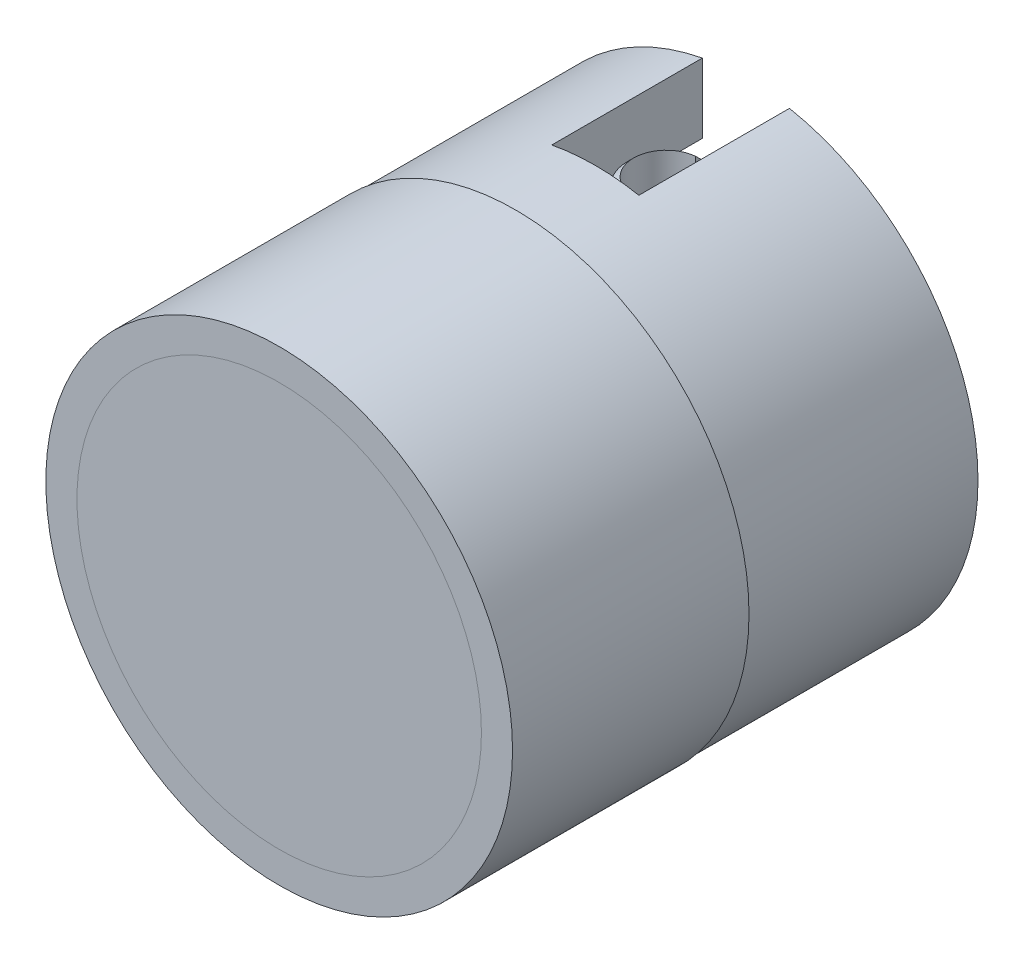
ISO-10303-21;
HEADER;
FILE_DESCRIPTION(('STEP AP214'),'2;1');
FILE_NAME('part.step','',(''),(''),'','','');
FILE_SCHEMA(('AUTOMOTIVE_DESIGN { 1 0 10303 214 1 1 1 1 }'));
ENDSEC;
DATA;
#1=APPLICATION_CONTEXT('core data for automotive mechanical design processes');
#2=APPLICATION_PROTOCOL_DEFINITION('international standard','automotive_design',2000,#1);
#3=PRODUCT_CONTEXT('',#1,'mechanical');
#4=PRODUCT('Part','Part','',(#3));
#5=PRODUCT_RELATED_PRODUCT_CATEGORY('part','',(#4));
#6=PRODUCT_DEFINITION_FORMATION('','',#4);
#7=PRODUCT_DEFINITION_CONTEXT('part definition',#1,'design');
#8=PRODUCT_DEFINITION('design','',#6,#7);
#9=PRODUCT_DEFINITION_SHAPE('','',#8);
#10=(LENGTH_UNIT() NAMED_UNIT(*) SI_UNIT(.MILLI.,.METRE.));
#11=(NAMED_UNIT(*) PLANE_ANGLE_UNIT() SI_UNIT($,.RADIAN.));
#12=(NAMED_UNIT(*) SI_UNIT($,.STERADIAN.) SOLID_ANGLE_UNIT());
#13=UNCERTAINTY_MEASURE_WITH_UNIT(LENGTH_MEASURE(1.E-05),#10,'distance_accuracy_value','');
#14=(GEOMETRIC_REPRESENTATION_CONTEXT(3) GLOBAL_UNCERTAINTY_ASSIGNED_CONTEXT((#13)) GLOBAL_UNIT_ASSIGNED_CONTEXT((#10,
#11,#12)) REPRESENTATION_CONTEXT('',''));
#15=CARTESIAN_POINT('',(0.,0.,0.));
#16=DIRECTION('',(0.,0.,1.));
#17=DIRECTION('',(1.,0.,0.));
#18=AXIS2_PLACEMENT_3D('',#15,#16,#17);
#19=CARTESIAN_POINT('',(0.,4.7371,-9.525));
#20=DIRECTION('',(0.,0.,1.));
#21=DIRECTION('',(1.,0.,0.));
#22=AXIS2_PLACEMENT_3D('',#19,#20,#21);
#23=PLANE('',#22);
#24=CARTESIAN_POINT('',(0.,0.,-9.525));
#25=DIRECTION('',(0.,0.,1.));
#26=DIRECTION('',(1.,0.,0.));
#27=AXIS2_PLACEMENT_3D('',#24,#25,#26);
#28=CIRCLE('',#27,4.7371);
#29=CARTESIAN_POINT('',(-0.889,4.65293406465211,-9.525));
#30=VERTEX_POINT('',#29);
#31=CARTESIAN_POINT('',(-0.889,-4.65293406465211,-9.525));
#32=VERTEX_POINT('',#31);
#33=EDGE_CURVE('P0_E139',#30,#32,#28,.T.);
#34=ORIENTED_EDGE('',*,*,#33,.F.);
#35=DIRECTION('',(0.,-1.,0.));
#36=VECTOR('',#35,1.);
#37=CARTESIAN_POINT('',(-0.889,4.7371,-9.525));
#38=LINE('',#37,#36);
#39=CARTESIAN_POINT('',(-0.889,3.23279242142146,-9.525));
#40=VERTEX_POINT('',#39);
#41=EDGE_CURVE('P0_E108',#30,#40,#38,.T.);
#42=ORIENTED_EDGE('',*,*,#41,.T.);
#43=CARTESIAN_POINT('',(0.,0.,-9.525));
#44=DIRECTION('',(0.,0.,-1.));
#45=DIRECTION('',(-1.,0.,0.));
#46=AXIS2_PLACEMENT_3D('',#43,#44,#45);
#47=CIRCLE('',#46,3.3528);
#48=CARTESIAN_POINT('',(-0.889,-3.23279242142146,-9.525));
#49=VERTEX_POINT('',#48);
#50=EDGE_CURVE('P0_E106',#49,#40,#47,.T.);
#51=ORIENTED_EDGE('',*,*,#50,.F.);
#52=EDGE_CURVE('P0_E87',#49,#32,#38,.T.);
#53=ORIENTED_EDGE('',*,*,#52,.T.);
#54=EDGE_LOOP('',(#34,#42,#51,#53));
#55=FACE_BOUND('',#54,.T.);
#56=ADVANCED_FACE('P0_F16',(#55),#23,.F.);
#57=CARTESIAN_POINT('',(0.,0.,0.));
#58=DIRECTION('',(0.,0.,-1.));
#59=DIRECTION('',(-1.,0.,0.));
#60=AXIS2_PLACEMENT_3D('',#57,#58,#59);
#61=CYLINDRICAL_SURFACE('',#60,1.778);
#62=CARTESIAN_POINT('',(0.,0.,-2.25197045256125));
#63=DIRECTION('',(0.,0.,1.));
#64=DIRECTION('',(1.,0.,0.));
#65=AXIS2_PLACEMENT_3D('',#62,#63,#64);
#66=CIRCLE('',#65,1.778);
#67=CARTESIAN_POINT('',(-1.778,0.,-2.25197045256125));
#68=VERTEX_POINT('',#67);
#69=EDGE_CURVE('P0_E122',#68,#68,#66,.T.);
#70=CARTESIAN_POINT('',(0.,0.,-2.921));
#71=DIRECTION('',(0.,0.,-1.));
#72=DIRECTION('',(-1.,0.,0.));
#73=AXIS2_PLACEMENT_3D('',#70,#71,#72);
#74=CIRCLE('',#73,1.778);
#75=CARTESIAN_POINT('',(-1.778,0.,-2.921));
#76=VERTEX_POINT('',#75);
#77=EDGE_CURVE('P0_E115',#76,#76,#74,.F.);
#78=CARTESIAN_POINT('',(-1.778,0.,-2.25197045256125));
#79=CARTESIAN_POINT('',(-1.778,0.,-2.25893951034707));
#80=CARTESIAN_POINT('',(-1.778,0.,-2.26590856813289));
#81=CARTESIAN_POINT('',(-1.778,0.,-2.27984668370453));
#82=CARTESIAN_POINT('',(-1.778,0.,-2.28681574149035));
#83=CARTESIAN_POINT('',(-1.778,0.,-2.30075385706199));
#84=CARTESIAN_POINT('',(-1.778,0.,-2.30772291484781));
#85=CARTESIAN_POINT('',(-1.778,0.,-2.32166103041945));
#86=CARTESIAN_POINT('',(-1.778,0.,-2.32863008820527));
#87=CARTESIAN_POINT('',(-1.778,0.,-2.34256820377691));
#88=CARTESIAN_POINT('',(-1.778,0.,-2.34953726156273));
#89=CARTESIAN_POINT('',(-1.778,0.,-2.36347537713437));
#90=CARTESIAN_POINT('',(-1.778,0.,-2.37044443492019));
#91=CARTESIAN_POINT('',(-1.778,0.,-2.38438255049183));
#92=CARTESIAN_POINT('',(-1.778,0.,-2.39135160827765));
#93=CARTESIAN_POINT('',(-1.778,0.,-2.40528972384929));
#94=CARTESIAN_POINT('',(-1.778,0.,-2.41225878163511));
#95=CARTESIAN_POINT('',(-1.778,0.,-2.42619689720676));
#96=CARTESIAN_POINT('',(-1.778,0.,-2.43316595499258));
#97=CARTESIAN_POINT('',(-1.778,0.,-2.44710407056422));
#98=CARTESIAN_POINT('',(-1.778,0.,-2.45407312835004));
#99=CARTESIAN_POINT('',(-1.778,0.,-2.46801124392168));
#100=CARTESIAN_POINT('',(-1.778,0.,-2.4749803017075));
#101=CARTESIAN_POINT('',(-1.778,0.,-2.48891841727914));
#102=CARTESIAN_POINT('',(-1.778,0.,-2.49588747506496));
#103=CARTESIAN_POINT('',(-1.778,0.,-2.5098255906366));
#104=CARTESIAN_POINT('',(-1.778,0.,-2.51679464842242));
#105=CARTESIAN_POINT('',(-1.778,0.,-2.53073276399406));
#106=CARTESIAN_POINT('',(-1.778,0.,-2.53770182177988));
#107=CARTESIAN_POINT('',(-1.778,0.,-2.55163993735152));
#108=CARTESIAN_POINT('',(-1.778,0.,-2.55860899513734));
#109=CARTESIAN_POINT('',(-1.778,0.,-2.57254711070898));
#110=CARTESIAN_POINT('',(-1.778,0.,-2.5795161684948));
#111=CARTESIAN_POINT('',(-1.778,0.,-2.59345428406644));
#112=CARTESIAN_POINT('',(-1.778,0.,-2.60042334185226));
#113=CARTESIAN_POINT('',(-1.778,0.,-2.6143614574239));
#114=CARTESIAN_POINT('',(-1.778,0.,-2.62133051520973));
#115=CARTESIAN_POINT('',(-1.778,0.,-2.63526863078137));
#116=CARTESIAN_POINT('',(-1.778,0.,-2.64223768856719));
#117=CARTESIAN_POINT('',(-1.778,0.,-2.65617580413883));
#118=CARTESIAN_POINT('',(-1.778,0.,-2.66314486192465));
#119=CARTESIAN_POINT('',(-1.778,0.,-2.67708297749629));
#120=CARTESIAN_POINT('',(-1.778,0.,-2.68405203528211));
#121=CARTESIAN_POINT('',(-1.778,0.,-2.69799015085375));
#122=CARTESIAN_POINT('',(-1.778,0.,-2.70495920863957));
#123=CARTESIAN_POINT('',(-1.778,0.,-2.71889732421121));
#124=CARTESIAN_POINT('',(-1.778,0.,-2.72586638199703));
#125=CARTESIAN_POINT('',(-1.778,0.,-2.73980449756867));
#126=CARTESIAN_POINT('',(-1.778,0.,-2.74677355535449));
#127=CARTESIAN_POINT('',(-1.778,0.,-2.76071167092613));
#128=CARTESIAN_POINT('',(-1.778,0.,-2.76768072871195));
#129=CARTESIAN_POINT('',(-1.778,0.,-2.78161884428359));
#130=CARTESIAN_POINT('',(-1.778,0.,-2.78858790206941));
#131=CARTESIAN_POINT('',(-1.778,0.,-2.80252601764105));
#132=CARTESIAN_POINT('',(-1.778,0.,-2.80949507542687));
#133=CARTESIAN_POINT('',(-1.778,0.,-2.82343319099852));
#134=CARTESIAN_POINT('',(-1.778,0.,-2.83040224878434));
#135=CARTESIAN_POINT('',(-1.778,0.,-2.84434036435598));
#136=CARTESIAN_POINT('',(-1.778,0.,-2.8513094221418));
#137=CARTESIAN_POINT('',(-1.778,0.,-2.86524753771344));
#138=CARTESIAN_POINT('',(-1.778,0.,-2.87221659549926));
#139=CARTESIAN_POINT('',(-1.778,0.,-2.8861547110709));
#140=CARTESIAN_POINT('',(-1.778,0.,-2.89312376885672));
#141=CARTESIAN_POINT('',(-1.778,0.,-2.90706188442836));
#142=CARTESIAN_POINT('',(-1.778,0.,-2.91403094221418));
#143=CARTESIAN_POINT('',(-1.778,0.,-2.921));
#144=B_SPLINE_CURVE_WITH_KNOTS('',3,(#78,#79,#80,#81,#82,#83,#84,#85,#86,#87,#88,#89,#90,#91,
#92,#93,#94,#95,#96,#97,#98,#99,#100,#101,#102,#103,#104,#105,#106,#107,#108,#109,#110,#111,
#112,#113,#114,#115,#116,#117,#118,#119,#120,#121,#122,#123,#124,#125,#126,#127,#128,#129,#130,
#131,#132,#133,#134,#135,#136,#137,#138,#139,#140,#141,#142,#143),.UNSPECIFIED.,.F.,.F.,(4,2,2,
2,2,2,2,2,2,2,2,2,2,2,2,2,2,2,2,2,2,2,2,2,2,2,2,2,2,2,2,2,4),(0.,0.0209071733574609,
0.0418143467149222,0.0627215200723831,0.0836286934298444,0.104535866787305,0.125443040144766,
0.146350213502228,0.167257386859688,0.188164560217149,0.209071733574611,0.229978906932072,
0.250886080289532,0.271793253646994,0.292700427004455,0.313607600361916,0.334514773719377,
0.355421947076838,0.376329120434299,0.39723629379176,0.418143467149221,0.439050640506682,
0.459957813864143,0.480864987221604,0.501772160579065,0.522679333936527,0.543586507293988,
0.564493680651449,0.585400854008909,0.606308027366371,0.627215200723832,0.648122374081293,
0.669029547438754),.UNSPECIFIED.);
#145=EDGE_CURVE('P0_BSEAM192',#68,#76,#144,.T.);
#146=ORIENTED_EDGE('',*,*,#69,.T.);
#147=ORIENTED_EDGE('',*,*,#77,.F.);
#148=ORIENTED_EDGE('',*,*,#145,.T.);
#149=ORIENTED_EDGE('',*,*,#145,.F.);
#150=EDGE_LOOP('',(#146,#148,#147,#149));
#151=FACE_BOUND('',#150,.T.);
#152=ADVANCED_FACE('P0_F192',(#151),#61,.F.);
#153=CARTESIAN_POINT('',(0.,0.,0.));
#154=DIRECTION('',(0.,0.,1.));
#155=DIRECTION('',(1.,0.,0.));
#156=AXIS2_PLACEMENT_3D('',#153,#154,#155);
#157=CYLINDRICAL_SURFACE('',#156,4.7625);
#158=CARTESIAN_POINT('',(0.,0.,0.));
#159=DIRECTION('',(0.,0.,1.));
#160=DIRECTION('',(1.,0.,0.));
#161=AXIS2_PLACEMENT_3D('',#158,#159,#160);
#162=CIRCLE('',#161,4.7625);
#163=CARTESIAN_POINT('',(4.7625,0.,0.));
#164=VERTEX_POINT('',#163);
#165=EDGE_CURVE('P0_E128',#164,#164,#162,.T.);
#166=ORIENTED_EDGE('',*,*,#165,.F.);
#167=EDGE_LOOP('',(#166));
#168=FACE_BOUND('',#167,.T.);
#169=CARTESIAN_POINT('',(0.,0.,-4.826));
#170=DIRECTION('',(0.,0.,1.));
#171=DIRECTION('',(1.,0.,0.));
#172=AXIS2_PLACEMENT_3D('',#169,#170,#171);
#173=CIRCLE('',#172,4.7625);
#174=CARTESIAN_POINT('',(4.7625,0.,-4.826));
#175=VERTEX_POINT('',#174);
#176=EDGE_CURVE('P0_E143',#175,#175,#173,.T.);
#177=ORIENTED_EDGE('',*,*,#176,.T.);
#178=EDGE_LOOP('',(#177));
#179=FACE_BOUND('',#178,.T.);
#180=ADVANCED_FACE('P0_F18',(#168,#179),#157,.T.);
#181=CARTESIAN_POINT('',(0.,4.7625,-4.826));
#182=DIRECTION('',(0.,0.,1.));
#183=DIRECTION('',(1.,0.,0.));
#184=AXIS2_PLACEMENT_3D('',#181,#182,#183);
#185=PLANE('',#184);
#186=ORIENTED_EDGE('',*,*,#176,.F.);
#187=EDGE_LOOP('',(#186));
#188=FACE_BOUND('',#187,.T.);
#189=CARTESIAN_POINT('',(0.,0.,-4.826));
#190=DIRECTION('',(0.,0.,1.));
#191=DIRECTION('',(1.,0.,0.));
#192=AXIS2_PLACEMENT_3D('',#189,#190,#191);
#193=CIRCLE('',#192,4.7371);
#194=CARTESIAN_POINT('',(4.7371,0.,-4.826));
#195=VERTEX_POINT('',#194);
#196=EDGE_CURVE('P0_E140',#195,#195,#193,.T.);
#197=ORIENTED_EDGE('',*,*,#196,.T.);
#198=EDGE_LOOP('',(#197));
#199=FACE_BOUND('',#198,.T.);
#200=ADVANCED_FACE('P0_F211',(#188,#199),#185,.F.);
#201=CARTESIAN_POINT('',(0.,0.,0.));
#202=DIRECTION('',(0.,0.,1.));
#203=DIRECTION('',(1.,0.,0.));
#204=AXIS2_PLACEMENT_3D('',#201,#202,#203);
#205=CYLINDRICAL_SURFACE('',#204,4.7371);
#206=ORIENTED_EDGE('',*,*,#196,.F.);
#207=EDGE_LOOP('',(#206));
#208=FACE_BOUND('',#207,.T.);
#209=CARTESIAN_POINT('',(0.,0.,-6.4516));
#210=DIRECTION('',(0.,0.,1.));
#211=DIRECTION('',(1.,0.,0.));
#212=AXIS2_PLACEMENT_3D('',#209,#210,#211);
#213=CIRCLE('',#212,4.7371);
#214=CARTESIAN_POINT('',(0.889,4.65293406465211,-6.4516));
#215=VERTEX_POINT('',#214);
#216=CARTESIAN_POINT('',(-0.889,4.65293406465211,-6.4516));
#217=VERTEX_POINT('',#216);
#218=EDGE_CURVE('P0_E103',#215,#217,#213,.T.);
#219=ORIENTED_EDGE('',*,*,#218,.T.);
#220=DIRECTION('',(0.,0.,1.));
#221=VECTOR('',#220,1.);
#222=CARTESIAN_POINT('',(-0.889,4.65293406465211,0.));
#223=LINE('',#222,#221);
#224=EDGE_CURVE('P0_E104',#217,#30,#223,.F.);
#225=ORIENTED_EDGE('',*,*,#224,.T.);
#226=ORIENTED_EDGE('',*,*,#33,.T.);
#227=DIRECTION('',(0.,0.,1.));
#228=VECTOR('',#227,1.);
#229=CARTESIAN_POINT('',(-0.889,-4.65293406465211,0.));
#230=LINE('',#229,#228);
#231=CARTESIAN_POINT('',(-0.889,-4.65293406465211,-6.4516));
#232=VERTEX_POINT('',#231);
#233=EDGE_CURVE('P0_E102',#32,#232,#230,.T.);
#234=ORIENTED_EDGE('',*,*,#233,.T.);
#235=CARTESIAN_POINT('',(0.889,-4.65293406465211,-6.4516));
#236=VERTEX_POINT('',#235);
#237=EDGE_CURVE('P0_E92',#232,#236,#213,.T.);
#238=ORIENTED_EDGE('',*,*,#237,.T.);
#239=DIRECTION('',(0.,0.,1.));
#240=VECTOR('',#239,1.);
#241=CARTESIAN_POINT('',(0.889,-4.65293406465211,0.));
#242=LINE('',#241,#240);
#243=CARTESIAN_POINT('',(0.889,-4.65293406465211,-9.525));
#244=VERTEX_POINT('',#243);
#245=EDGE_CURVE('P0_E79',#236,#244,#242,.F.);
#246=ORIENTED_EDGE('',*,*,#245,.T.);
#247=CARTESIAN_POINT('',(0.889,4.65293406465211,-9.525));
#248=VERTEX_POINT('',#247);
#249=EDGE_CURVE('P0_E137',#244,#248,#28,.T.);
#250=ORIENTED_EDGE('',*,*,#249,.T.);
#251=DIRECTION('',(0.,0.,1.));
#252=VECTOR('',#251,1.);
#253=CARTESIAN_POINT('',(0.889,4.65293406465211,0.));
#254=LINE('',#253,#252);
#255=EDGE_CURVE('P0_E168',#248,#215,#254,.T.);
#256=ORIENTED_EDGE('',*,*,#255,.T.);
#257=EDGE_LOOP('',(#219,#225,#226,#234,#238,#246,#250,#256));
#258=FACE_BOUND('',#257,.T.);
#259=ADVANCED_FACE('P0_F100',(#208,#258),#205,.T.);
#260=ORIENTED_EDGE('',*,*,#249,.F.);
#261=DIRECTION('',(0.,1.,0.));
#262=VECTOR('',#261,1.);
#263=CARTESIAN_POINT('',(0.889,4.7371,-9.525));
#264=LINE('',#263,#262);
#265=CARTESIAN_POINT('',(0.889,-3.23279242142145,-9.525));
#266=VERTEX_POINT('',#265);
#267=EDGE_CURVE('P0_E82',#244,#266,#264,.T.);
#268=ORIENTED_EDGE('',*,*,#267,.T.);
#269=CARTESIAN_POINT('',(0.889,3.23279242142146,-9.525));
#270=VERTEX_POINT('',#269);
#271=EDGE_CURVE('P0_E116',#270,#266,#47,.T.);
#272=ORIENTED_EDGE('',*,*,#271,.F.);
#273=EDGE_CURVE('P0_E39',#270,#248,#264,.T.);
#274=ORIENTED_EDGE('',*,*,#273,.T.);
#275=EDGE_LOOP('',(#260,#268,#272,#274));
#276=FACE_BOUND('',#275,.T.);
#277=ADVANCED_FACE('P0_F194',(#276),#23,.F.);
#278=CARTESIAN_POINT('',(0.,3.65108633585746,-1.778));
#279=DIRECTION('',(0.,0.,-1.));
#280=DIRECTION('',(-1.,0.,0.));
#281=AXIS2_PLACEMENT_3D('',#278,#279,#280);
#282=PLANE('',#281);
#283=CARTESIAN_POINT('',(0.,0.,-1.778));
#284=DIRECTION('',(0.,0.,1.));
#285=DIRECTION('',(1.,0.,0.));
#286=AXIS2_PLACEMENT_3D('',#283,#284,#285);
#287=CIRCLE('',#286,2.159);
#288=CARTESIAN_POINT('',(2.159,0.,-1.778));
#289=VERTEX_POINT('',#288);
#290=EDGE_CURVE('P0_E125',#289,#289,#287,.T.);
#291=ORIENTED_EDGE('',*,*,#290,.F.);
#292=EDGE_LOOP('',(#291));
#293=FACE_BOUND('',#292,.T.);
#294=CARTESIAN_POINT('',(0.,0.,-1.778));
#295=DIRECTION('',(0.,0.,1.));
#296=DIRECTION('',(1.,0.,0.));
#297=AXIS2_PLACEMENT_3D('',#294,#295,#296);
#298=CIRCLE('',#297,3.65108633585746);
#299=CARTESIAN_POINT('',(3.65108633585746,0.,-1.778));
#300=VERTEX_POINT('',#299);
#301=EDGE_CURVE('P0_E134',#300,#300,#298,.T.);
#302=ORIENTED_EDGE('',*,*,#301,.T.);
#303=EDGE_LOOP('',(#302));
#304=FACE_BOUND('',#303,.T.);
#305=ADVANCED_FACE('P0_F203',(#293,#304),#282,.F.);
#306=CARTESIAN_POINT('',(0.,0.,0.));
#307=DIRECTION('',(0.,0.,1.));
#308=DIRECTION('',(1.,0.,0.));
#309=AXIS2_PLACEMENT_3D('',#306,#307,#308);
#310=CONICAL_SURFACE('',#309,4.1275,0.26179938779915);
#311=ORIENTED_EDGE('',*,*,#301,.F.);
#312=EDGE_LOOP('',(#311));
#313=FACE_BOUND('',#312,.T.);
#314=CARTESIAN_POINT('',(0.,0.,0.));
#315=DIRECTION('',(0.,0.,1.));
#316=DIRECTION('',(1.,0.,0.));
#317=AXIS2_PLACEMENT_3D('',#314,#315,#316);
#318=CIRCLE('',#317,4.1275);
#319=CARTESIAN_POINT('',(4.1275,0.,0.));
#320=VERTEX_POINT('',#319);
#321=EDGE_CURVE('P0_E131',#320,#320,#318,.T.);
#322=ORIENTED_EDGE('',*,*,#321,.T.);
#323=EDGE_LOOP('',(#322));
#324=FACE_BOUND('',#323,.T.);
#325=ADVANCED_FACE('P0_F209',(#313,#324),#310,.F.);
#326=CARTESIAN_POINT('',(0.,4.1275,0.));
#327=DIRECTION('',(0.,0.,-1.));
#328=DIRECTION('',(-1.,0.,0.));
#329=AXIS2_PLACEMENT_3D('',#326,#327,#328);
#330=PLANE('',#329);
#331=ORIENTED_EDGE('',*,*,#321,.F.);
#332=EDGE_LOOP('',(#331));
#333=FACE_BOUND('',#332,.T.);
#334=ORIENTED_EDGE('',*,*,#165,.T.);
#335=EDGE_LOOP('',(#334));
#336=FACE_BOUND('',#335,.T.);
#337=ADVANCED_FACE('P0_F233',(#333,#336),#330,.F.);
#338=CARTESIAN_POINT('',(0.,0.,-2.032));
#339=DIRECTION('',(0.,0.,1.));
#340=DIRECTION('',(1.,0.,0.));
#341=AXIS2_PLACEMENT_3D('',#338,#339,#340);
#342=CYLINDRICAL_SURFACE('',#341,2.159);
#343=CARTESIAN_POINT('',(0.,0.,-2.032));
#344=DIRECTION('',(0.,0.,1.));
#345=DIRECTION('',(1.,0.,0.));
#346=AXIS2_PLACEMENT_3D('',#343,#344,#345);
#347=CIRCLE('',#346,2.159);
#348=CARTESIAN_POINT('',(2.159,0.,-2.032));
#349=VERTEX_POINT('',#348);
#350=EDGE_CURVE('P0_E119',#349,#349,#347,.T.);
#351=ORIENTED_EDGE('',*,*,#350,.F.);
#352=EDGE_LOOP('',(#351));
#353=FACE_BOUND('',#352,.T.);
#354=ORIENTED_EDGE('',*,*,#290,.T.);
#355=EDGE_LOOP('',(#354));
#356=FACE_BOUND('',#355,.T.);
#357=ADVANCED_FACE('P0_F230',(#353,#356),#342,.F.);
#358=CARTESIAN_POINT('',(0.,0.,-2.032));
#359=DIRECTION('',(0.,0.,1.));
#360=DIRECTION('',(1.,0.,0.));
#361=AXIS2_PLACEMENT_3D('',#358,#359,#360);
#362=CONICAL_SURFACE('',#361,2.159,1.0471975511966);
#363=ORIENTED_EDGE('',*,*,#350,.T.);
#364=EDGE_LOOP('',(#363));
#365=FACE_BOUND('',#364,.T.);
#366=ORIENTED_EDGE('',*,*,#69,.F.);
#367=EDGE_LOOP('',(#366));
#368=FACE_BOUND('',#367,.T.);
#369=ADVANCED_FACE('P0_F223',(#365,#368),#362,.F.);
#370=CARTESIAN_POINT('',(0.,0.,-2.921));
#371=DIRECTION('',(0.,0.,-1.));
#372=DIRECTION('',(-1.,0.,0.));
#373=AXIS2_PLACEMENT_3D('',#370,#371,#372);
#374=PLANE('',#373);
#375=CARTESIAN_POINT('',(0.,0.,-2.921));
#376=DIRECTION('',(0.,0.,-1.));
#377=DIRECTION('',(-1.,0.,0.));
#378=AXIS2_PLACEMENT_3D('',#375,#376,#377);
#379=CIRCLE('',#378,3.3528);
#380=CARTESIAN_POINT('',(-3.3528,0.,-2.921));
#381=VERTEX_POINT('',#380);
#382=EDGE_CURVE('P0_E112',#381,#381,#379,.T.);
#383=ORIENTED_EDGE('',*,*,#382,.T.);
#384=EDGE_LOOP('',(#383));
#385=FACE_BOUND('',#384,.T.);
#386=ORIENTED_EDGE('',*,*,#77,.T.);
#387=EDGE_LOOP('',(#386));
#388=FACE_BOUND('',#387,.T.);
#389=ADVANCED_FACE('P0_F220',(#385,#388),#374,.T.);
#390=CARTESIAN_POINT('',(0.,0.,-2.921));
#391=DIRECTION('',(0.,0.,-1.));
#392=DIRECTION('',(-1.,0.,0.));
#393=AXIS2_PLACEMENT_3D('',#390,#391,#392);
#394=CYLINDRICAL_SURFACE('',#393,3.3528);
#395=ORIENTED_EDGE('',*,*,#382,.F.);
#396=EDGE_LOOP('',(#395));
#397=FACE_BOUND('',#396,.T.);
#398=CARTESIAN_POINT('',(0.,0.,-6.4516));
#399=DIRECTION('',(0.,0.,1.));
#400=DIRECTION('',(1.,0.,0.));
#401=AXIS2_PLACEMENT_3D('',#398,#399,#400);
#402=CIRCLE('',#401,3.3528);
#403=CARTESIAN_POINT('',(0.889,-3.23279242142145,-6.4516));
#404=VERTEX_POINT('',#403);
#405=CARTESIAN_POINT('',(-0.889,-3.23279242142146,-6.4516));
#406=VERTEX_POINT('',#405);
#407=EDGE_CURVE('P0_E24',#404,#406,#402,.F.);
#408=ORIENTED_EDGE('',*,*,#407,.T.);
#409=DIRECTION('',(0.,0.,-1.));
#410=VECTOR('',#409,1.);
#411=CARTESIAN_POINT('',(-0.889,-3.23279242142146,-2.921));
#412=LINE('',#411,#410);
#413=EDGE_CURVE('P0_E10',#406,#49,#412,.T.);
#414=ORIENTED_EDGE('',*,*,#413,.T.);
#415=ORIENTED_EDGE('',*,*,#50,.T.);
#416=DIRECTION('',(0.,0.,-1.));
#417=VECTOR('',#416,1.);
#418=CARTESIAN_POINT('',(-0.889,3.23279242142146,-2.921));
#419=LINE('',#418,#417);
#420=CARTESIAN_POINT('',(-0.889,3.23279242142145,-6.4516));
#421=VERTEX_POINT('',#420);
#422=EDGE_CURVE('P0_E153',#40,#421,#419,.F.);
#423=ORIENTED_EDGE('',*,*,#422,.T.);
#424=CARTESIAN_POINT('',(0.889,3.23279242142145,-6.4516));
#425=VERTEX_POINT('',#424);
#426=EDGE_CURVE('P0_E150',#421,#425,#402,.F.);
#427=ORIENTED_EDGE('',*,*,#426,.T.);
#428=DIRECTION('',(0.,0.,-1.));
#429=VECTOR('',#428,1.);
#430=CARTESIAN_POINT('',(0.889,3.23279242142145,-2.921));
#431=LINE('',#430,#429);
#432=EDGE_CURVE('P0_E146',#425,#270,#431,.T.);
#433=ORIENTED_EDGE('',*,*,#432,.T.);
#434=ORIENTED_EDGE('',*,*,#271,.T.);
#435=DIRECTION('',(0.,0.,-1.));
#436=VECTOR('',#435,1.);
#437=CARTESIAN_POINT('',(0.889,-3.23279242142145,-2.921));
#438=LINE('',#437,#436);
#439=EDGE_CURVE('P0_E155',#266,#404,#438,.F.);
#440=ORIENTED_EDGE('',*,*,#439,.T.);
#441=EDGE_LOOP('',(#408,#414,#415,#423,#427,#433,#434,#440));
#442=FACE_BOUND('',#441,.T.);
#443=ADVANCED_FACE('P0_F158',(#397,#442),#394,.F.);
#444=CARTESIAN_POINT('',(-0.889,-4.7625,-7.3152));
#445=DIRECTION('',(-1.,0.,0.));
#446=DIRECTION('',(0.,0.,1.));
#447=AXIS2_PLACEMENT_3D('',#444,#445,#446);
#448=PLANE('',#447);
#449=DIRECTION('',(0.,1.,0.));
#450=VECTOR('',#449,1.);
#451=CARTESIAN_POINT('',(-0.889,-4.7625,-6.4516));
#452=LINE('',#451,#450);
#453=EDGE_CURVE('P0_E172',#421,#217,#452,.T.);
#454=ORIENTED_EDGE('',*,*,#453,.F.);
#455=ORIENTED_EDGE('',*,*,#422,.F.);
#456=ORIENTED_EDGE('',*,*,#41,.F.);
#457=ORIENTED_EDGE('',*,*,#224,.F.);
#458=EDGE_LOOP('',(#454,#455,#456,#457));
#459=FACE_BOUND('',#458,.T.);
#460=ADVANCED_FACE('P0_F180',(#459),#448,.F.);
#461=CARTESIAN_POINT('',(0.889,-4.7625,-7.3152));
#462=DIRECTION('',(1.,0.,0.));
#463=DIRECTION('',(0.,0.,-1.));
#464=AXIS2_PLACEMENT_3D('',#461,#462,#463);
#465=PLANE('',#464);
#466=ORIENTED_EDGE('',*,*,#273,.F.);
#467=ORIENTED_EDGE('',*,*,#432,.F.);
#468=DIRECTION('',(0.,1.,0.));
#469=VECTOR('',#468,1.);
#470=CARTESIAN_POINT('',(0.889,-4.7625,-6.4516));
#471=LINE('',#470,#469);
#472=EDGE_CURVE('P0_E96',#425,#215,#471,.T.);
#473=ORIENTED_EDGE('',*,*,#472,.T.);
#474=ORIENTED_EDGE('',*,*,#255,.F.);
#475=EDGE_LOOP('',(#466,#467,#473,#474));
#476=FACE_BOUND('',#475,.T.);
#477=ADVANCED_FACE('P0_F187',(#476),#465,.F.);
#478=CARTESIAN_POINT('',(0.0253999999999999,-4.7625,-6.4516));
#479=DIRECTION('',(0.,0.,1.));
#480=DIRECTION('',(1.,0.,0.));
#481=AXIS2_PLACEMENT_3D('',#478,#479,#480);
#482=PLANE('',#481);
#483=ORIENTED_EDGE('',*,*,#472,.F.);
#484=ORIENTED_EDGE('',*,*,#426,.F.);
#485=ORIENTED_EDGE('',*,*,#453,.T.);
#486=ORIENTED_EDGE('',*,*,#218,.F.);
#487=EDGE_LOOP('',(#483,#484,#485,#486));
#488=FACE_BOUND('',#487,.T.);
#489=ADVANCED_FACE('P0_F188',(#488),#482,.F.);
#490=EDGE_CURVE('P0_E174',#232,#406,#452,.T.);
#491=ORIENTED_EDGE('',*,*,#490,.T.);
#492=ORIENTED_EDGE('',*,*,#407,.F.);
#493=EDGE_CURVE('P0_E31',#236,#404,#471,.T.);
#494=ORIENTED_EDGE('',*,*,#493,.F.);
#495=ORIENTED_EDGE('',*,*,#237,.F.);
#496=EDGE_LOOP('',(#491,#492,#494,#495));
#497=FACE_BOUND('',#496,.T.);
#498=ADVANCED_FACE('P0_F91',(#497),#482,.F.);
#499=ORIENTED_EDGE('',*,*,#52,.F.);
#500=ORIENTED_EDGE('',*,*,#413,.F.);
#501=ORIENTED_EDGE('',*,*,#490,.F.);
#502=ORIENTED_EDGE('',*,*,#233,.F.);
#503=EDGE_LOOP('',(#499,#500,#501,#502));
#504=FACE_BOUND('',#503,.T.);
#505=ADVANCED_FACE('P0_F177',(#504),#448,.F.);
#506=ORIENTED_EDGE('',*,*,#493,.T.);
#507=ORIENTED_EDGE('',*,*,#439,.F.);
#508=ORIENTED_EDGE('',*,*,#267,.F.);
#509=ORIENTED_EDGE('',*,*,#245,.F.);
#510=EDGE_LOOP('',(#506,#507,#508,#509));
#511=FACE_BOUND('',#510,.T.);
#512=ADVANCED_FACE('P0_F80',(#511),#465,.F.);
#513=CLOSED_SHELL('',(#56,#152,#180,#200,#259,#277,#305,#325,#337,#357,#369,#389,#443,#460,#477,
#489,#498,#505,#512));
#514=MANIFOLD_SOLID_BREP('P0_B1',#513);
#515=CARTESIAN_POINT('',(0.,3.81,-7.8994));
#516=DIRECTION('',(0.,-1.,0.));
#517=DIRECTION('',(-1.,0.,0.));
#518=AXIS2_PLACEMENT_3D('',#515,#516,#517);
#519=CYLINDRICAL_SURFACE('',#518,0.79375);
#520=DIRECTION('',(0.,-1.,0.));
#521=VECTOR('',#520,1.);
#522=CARTESIAN_POINT('',(-0.0635,3.81,-8.69060592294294));
#523=LINE('',#522,#521);
#524=CARTESIAN_POINT('',(-0.0635,3.683,-8.69060592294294));
#525=VERTEX_POINT('',#524);
#526=CARTESIAN_POINT('',(-0.0635,-3.68299999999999,-8.69060592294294));
#527=VERTEX_POINT('',#526);
#528=EDGE_CURVE('P1_E83',#525,#527,#523,.T.);
#529=ORIENTED_EDGE('',*,*,#528,.T.);
#530=CARTESIAN_POINT('',(0.,-3.68299999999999,-7.8994));
#531=DIRECTION('',(0.,1.,0.));
#532=DIRECTION('',(1.,0.,0.));
#533=AXIS2_PLACEMENT_3D('',#530,#531,#532);
#534=CIRCLE('',#533,0.79375);
#535=CARTESIAN_POINT('',(0.0635,-3.68299999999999,-8.69060592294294));
#536=VERTEX_POINT('',#535);
#537=EDGE_CURVE('P1_E71',#527,#536,#534,.T.);
#538=ORIENTED_EDGE('',*,*,#537,.T.);
#539=DIRECTION('',(0.,-1.,0.));
#540=VECTOR('',#539,1.);
#541=CARTESIAN_POINT('',(0.0635,3.81,-8.69060592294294));
#542=LINE('',#541,#540);
#543=CARTESIAN_POINT('',(0.0635,3.683,-8.69060592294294));
#544=VERTEX_POINT('',#543);
#545=EDGE_CURVE('P1_E78',#544,#536,#542,.T.);
#546=ORIENTED_EDGE('',*,*,#545,.F.);
#547=CARTESIAN_POINT('',(0.,3.683,-7.8994));
#548=DIRECTION('',(0.,1.,0.));
#549=DIRECTION('',(1.,0.,0.));
#550=AXIS2_PLACEMENT_3D('',#547,#548,#549);
#551=CIRCLE('',#550,0.79375);
#552=EDGE_CURVE('P1_E43',#544,#525,#551,.F.);
#553=ORIENTED_EDGE('',*,*,#552,.T.);
#554=EDGE_LOOP('',(#529,#538,#546,#553));
#555=FACE_BOUND('',#554,.T.);
#556=ADVANCED_FACE('P1_F17',(#555),#519,.T.);
#557=CARTESIAN_POINT('',(0.0635,3.81,-8.69060592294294));
#558=DIRECTION('',(1.,0.,0.));
#559=DIRECTION('',(0.,-1.,0.));
#560=AXIS2_PLACEMENT_3D('',#557,#558,#559);
#561=PLANE('',#560);
#562=ORIENTED_EDGE('',*,*,#545,.T.);
#563=CARTESIAN_POINT('',(0.0635,-3.68299999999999,-8.69060592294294));
#564=CARTESIAN_POINT('',(0.0635,-3.70417375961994,-8.66936521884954));
#565=CARTESIAN_POINT('',(0.0635,-3.72534397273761,-8.64812098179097));
#566=CARTESIAN_POINT('',(0.0635,-3.76767730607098,-8.60562544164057));
#567=CARTESIAN_POINT('',(0.0635,-3.78884042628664,-8.5843741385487));
#568=CARTESIAN_POINT('',(0.0635,-3.81,-8.56311930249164));
#569=B_SPLINE_CURVE_WITH_KNOTS('',3,(#563,#564,#565,#566,#567,#568),.UNSPECIFIED.,.F.,.F.,(4,2,
4),(0.,0.0899747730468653,0.179949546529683),.UNSPECIFIED.);
#570=CARTESIAN_POINT('',(0.0635,-3.81,-8.56311930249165));
#571=VERTEX_POINT('',#570);
#572=EDGE_CURVE('P1_E70',#536,#571,#569,.T.);
#573=ORIENTED_EDGE('',*,*,#572,.T.);
#574=DIRECTION('',(0.,-1.,0.));
#575=VECTOR('',#574,1.);
#576=CARTESIAN_POINT('',(0.0635,3.81,-8.56311930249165));
#577=LINE('',#576,#575);
#578=CARTESIAN_POINT('',(0.0635,3.81,-8.56311930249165));
#579=VERTEX_POINT('',#578);
#580=EDGE_CURVE('P1_E74',#579,#571,#577,.T.);
#581=ORIENTED_EDGE('',*,*,#580,.F.);
#582=CARTESIAN_POINT('',(0.0635,3.81,-8.56311930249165));
#583=CARTESIAN_POINT('',(0.0635,3.78884042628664,-8.58437413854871));
#584=CARTESIAN_POINT('',(0.0635,3.76767730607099,-8.60562544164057));
#585=CARTESIAN_POINT('',(0.0635,3.72534397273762,-8.64812098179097));
#586=CARTESIAN_POINT('',(0.0635,3.70417375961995,-8.66936521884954));
#587=CARTESIAN_POINT('',(0.0635,3.683,-8.69060592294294));
#588=B_SPLINE_CURVE_WITH_KNOTS('',3,(#582,#583,#584,#585,#586,#587),.UNSPECIFIED.,.F.,.F.,(4,2,
4),(0.,0.0899747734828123,0.179949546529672),.UNSPECIFIED.);
#589=EDGE_CURVE('P1_E63',#579,#544,#588,.T.);
#590=ORIENTED_EDGE('',*,*,#589,.T.);
#591=EDGE_LOOP('',(#562,#573,#581,#590));
#592=FACE_BOUND('',#591,.T.);
#593=ADVANCED_FACE('P1_F75',(#592),#561,.F.);
#594=CARTESIAN_POINT('',(0.,3.81,-7.8994));
#595=DIRECTION('',(0.,-1.,0.));
#596=DIRECTION('',(-1.,0.,0.));
#597=AXIS2_PLACEMENT_3D('',#594,#595,#596);
#598=CYLINDRICAL_SURFACE('',#597,0.66675);
#599=CARTESIAN_POINT('',(0.,-3.81,-7.8994));
#600=DIRECTION('',(0.,-1.,0.));
#601=DIRECTION('',(1.,0.,0.));
#602=AXIS2_PLACEMENT_3D('',#599,#600,#601);
#603=CIRCLE('',#602,0.66675);
#604=CARTESIAN_POINT('',(-0.0635,-3.81,-8.56311930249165));
#605=VERTEX_POINT('',#604);
#606=EDGE_CURVE('P1_E84',#571,#605,#603,.T.);
#607=ORIENTED_EDGE('',*,*,#606,.T.);
#608=DIRECTION('',(0.,-1.,0.));
#609=VECTOR('',#608,1.);
#610=CARTESIAN_POINT('',(-0.0635,3.81,-8.56311930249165));
#611=LINE('',#610,#609);
#612=CARTESIAN_POINT('',(-0.0635,3.81,-8.56311930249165));
#613=VERTEX_POINT('',#612);
#614=EDGE_CURVE('P1_E79',#613,#605,#611,.T.);
#615=ORIENTED_EDGE('',*,*,#614,.F.);
#616=CARTESIAN_POINT('',(0.,3.81,-7.8994));
#617=DIRECTION('',(0.,-1.,0.));
#618=DIRECTION('',(1.,0.,0.));
#619=AXIS2_PLACEMENT_3D('',#616,#617,#618);
#620=CIRCLE('',#619,0.66675);
#621=EDGE_CURVE('P1_E67',#579,#613,#620,.T.);
#622=ORIENTED_EDGE('',*,*,#621,.F.);
#623=ORIENTED_EDGE('',*,*,#580,.T.);
#624=EDGE_LOOP('',(#607,#615,#622,#623));
#625=FACE_BOUND('',#624,.T.);
#626=ADVANCED_FACE('P1_F82',(#625),#598,.F.);
#627=CARTESIAN_POINT('',(-0.0635,3.81,-8.69060592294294));
#628=DIRECTION('',(-1.,0.,0.));
#629=DIRECTION('',(0.,1.,0.));
#630=AXIS2_PLACEMENT_3D('',#627,#628,#629);
#631=PLANE('',#630);
#632=ORIENTED_EDGE('',*,*,#614,.T.);
#633=CARTESIAN_POINT('',(-0.0635,-3.81,-8.56311930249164));
#634=CARTESIAN_POINT('',(-0.0635,-3.78884042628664,-8.5843741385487));
#635=CARTESIAN_POINT('',(-0.0635,-3.76767730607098,-8.60562544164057));
#636=CARTESIAN_POINT('',(-0.0635,-3.72534397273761,-8.64812098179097));
#637=CARTESIAN_POINT('',(-0.0635,-3.70417375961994,-8.66936521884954));
#638=CARTESIAN_POINT('',(-0.0635,-3.68299999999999,-8.69060592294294));
#639=B_SPLINE_CURVE_WITH_KNOTS('',3,(#633,#634,#635,#636,#637,#638),.UNSPECIFIED.,.F.,.F.,(4,2,
4),(0.,0.0899747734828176,0.179949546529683),.UNSPECIFIED.);
#640=EDGE_CURVE('P1_E11',#605,#527,#639,.T.);
#641=ORIENTED_EDGE('',*,*,#640,.T.);
#642=ORIENTED_EDGE('',*,*,#528,.F.);
#643=CARTESIAN_POINT('',(-0.0635,3.683,-8.69060592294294));
#644=CARTESIAN_POINT('',(-0.0635,3.70417375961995,-8.66936521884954));
#645=CARTESIAN_POINT('',(-0.0635,3.72534397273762,-8.64812098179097));
#646=CARTESIAN_POINT('',(-0.0635,3.76767730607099,-8.60562544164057));
#647=CARTESIAN_POINT('',(-0.0635,3.78884042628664,-8.58437413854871));
#648=CARTESIAN_POINT('',(-0.0635,3.81,-8.56311930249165));
#649=B_SPLINE_CURVE_WITH_KNOTS('',3,(#643,#644,#645,#646,#647,#648),.UNSPECIFIED.,.F.,.F.,(4,2,
4),(0.,0.0899747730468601,0.179949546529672),.UNSPECIFIED.);
#650=EDGE_CURVE('P1_E31',#525,#613,#649,.T.);
#651=ORIENTED_EDGE('',*,*,#650,.T.);
#652=EDGE_LOOP('',(#632,#641,#642,#651));
#653=FACE_BOUND('',#652,.T.);
#654=ADVANCED_FACE('P1_F112',(#653),#631,.F.);
#655=CARTESIAN_POINT('',(0.,-3.68299999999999,-7.8994));
#656=DIRECTION('',(0.,1.,0.));
#657=DIRECTION('',(1.,0.,0.));
#658=AXIS2_PLACEMENT_3D('',#655,#656,#657);
#659=CONICAL_SURFACE('',#658,0.79375,0.785398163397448);
#660=ORIENTED_EDGE('',*,*,#640,.F.);
#661=ORIENTED_EDGE('',*,*,#606,.F.);
#662=ORIENTED_EDGE('',*,*,#572,.F.);
#663=ORIENTED_EDGE('',*,*,#537,.F.);
#664=EDGE_LOOP('',(#660,#661,#662,#663));
#665=FACE_BOUND('',#664,.T.);
#666=ADVANCED_FACE('P1_F109',(#665),#659,.T.);
#667=CARTESIAN_POINT('',(0.,3.81,-7.8994));
#668=DIRECTION('',(0.,-1.,0.));
#669=DIRECTION('',(-1.,0.,0.));
#670=AXIS2_PLACEMENT_3D('',#667,#668,#669);
#671=CONICAL_SURFACE('',#670,0.666750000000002,0.785398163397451);
#672=ORIENTED_EDGE('',*,*,#650,.F.);
#673=ORIENTED_EDGE('',*,*,#552,.F.);
#674=ORIENTED_EDGE('',*,*,#589,.F.);
#675=ORIENTED_EDGE('',*,*,#621,.T.);
#676=EDGE_LOOP('',(#672,#673,#674,#675));
#677=FACE_BOUND('',#676,.T.);
#678=ADVANCED_FACE('P1_F19',(#677),#671,.T.);
#679=CLOSED_SHELL('',(#556,#593,#626,#654,#666,#678));
#680=MANIFOLD_SOLID_BREP('P1_B1',#679);
#681=CARTESIAN_POINT('',(2.921,0.,-6.600825));
#682=DIRECTION('',(0.,1.,0.));
#683=DIRECTION('',(0.,0.,1.));
#684=AXIS2_PLACEMENT_3D('',#681,#682,#683);
#685=PLANE('',#684);
#686=CARTESIAN_POINT('',(2.921,0.,-6.600825));
#687=DIRECTION('',(0.,1.,0.));
#688=DIRECTION('',(0.,0.,1.));
#689=AXIS2_PLACEMENT_3D('',#686,#687,#688);
#690=CIRCLE('',#689,0.254);
#691=CARTESIAN_POINT('',(2.921,0.,-6.346825));
#692=VERTEX_POINT('',#691);
#693=EDGE_CURVE('P2_E24',#692,#692,#690,.T.);
#694=ORIENTED_EDGE('',*,*,#693,.T.);
#695=EDGE_LOOP('',(#694));
#696=FACE_BOUND('',#695,.T.);
#697=ADVANCED_FACE('P2_F17',(#696),#685,.T.);
#698=CARTESIAN_POINT('',(-1.27393359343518E-13,-2.921,-3.175));
#699=DIRECTION('',(1.,0.,0.));
#700=DIRECTION('',(0.,0.,1.));
#701=AXIS2_PLACEMENT_3D('',#698,#699,#700);
#702=PLANE('',#701);
#703=CARTESIAN_POINT('',(-1.27393359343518E-13,-2.921,-3.175));
#704=DIRECTION('',(1.,0.,0.));
#705=DIRECTION('',(0.,0.,1.));
#706=AXIS2_PLACEMENT_3D('',#703,#704,#705);
#707=CIRCLE('',#706,0.254);
#708=CARTESIAN_POINT('',(-1.27393359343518E-13,-2.921,-2.921));
#709=VERTEX_POINT('',#708);
#710=EDGE_CURVE('P2_E11',#709,#709,#707,.T.);
#711=ORIENTED_EDGE('',*,*,#710,.F.);
#712=EDGE_LOOP('',(#711));
#713=FACE_BOUND('',#712,.T.);
#714=ADVANCED_FACE('P2_F33',(#713),#702,.F.);
#715=CARTESIAN_POINT('',(2.921,0.,-6.346825));
#716=CARTESIAN_POINT('',(2.921,-1.6864401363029,-6.25898333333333));
#717=CARTESIAN_POINT('',(1.4605,-2.52966020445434,-6.17114166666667));
#718=CARTESIAN_POINT('',(0.,-3.37288027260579,-6.0833));
#719=CARTESIAN_POINT('',(-1.4605,-2.52966020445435,-5.99545833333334));
#720=CARTESIAN_POINT('',(-2.921,-1.6864401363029,-5.90761666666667));
#721=CARTESIAN_POINT('',(-2.921,0.,-5.819775));
#722=CARTESIAN_POINT('',(-2.921,1.6864401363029,-5.73193333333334));
#723=CARTESIAN_POINT('',(-1.4605,2.52966020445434,-5.64409166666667));
#724=CARTESIAN_POINT('',(0.,3.37288027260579,-5.55625));
#725=CARTESIAN_POINT('',(1.4605,2.52966020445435,-5.46840833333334));
#726=CARTESIAN_POINT('',(2.921,1.6864401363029,-5.38056666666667));
#727=CARTESIAN_POINT('',(2.921,0.,-5.292725));
#728=CARTESIAN_POINT('',(2.921,-1.6864401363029,-5.20488333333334));
#729=CARTESIAN_POINT('',(1.4605,-2.52966020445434,-5.11704166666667));
#730=CARTESIAN_POINT('',(0.,-3.37288027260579,-5.0292));
#731=CARTESIAN_POINT('',(-1.4605,-2.52966020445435,-4.94135833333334));
#732=CARTESIAN_POINT('',(-2.921,-1.6864401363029,-4.85351666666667));
#733=CARTESIAN_POINT('',(-2.921,0.,-4.765675));
#734=CARTESIAN_POINT('',(-2.921,1.6864401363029,-4.67783333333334));
#735=CARTESIAN_POINT('',(-1.4605,2.52966020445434,-4.58999166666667));
#736=CARTESIAN_POINT('',(0.,3.37288027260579,-4.50215));
#737=CARTESIAN_POINT('',(1.4605,2.52966020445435,-4.41430833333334));
#738=CARTESIAN_POINT('',(2.921,1.6864401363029,-4.32646666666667));
#739=CARTESIAN_POINT('',(2.921,0.,-4.23862500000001));
#740=CARTESIAN_POINT('',(2.921,-1.6864401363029,-4.15078333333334));
#741=CARTESIAN_POINT('',(1.4605,-2.52966020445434,-4.06294166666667));
#742=CARTESIAN_POINT('',(0.,-3.37288027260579,-3.97510000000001));
#743=CARTESIAN_POINT('',(-1.4605,-2.52966020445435,-3.88725833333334));
#744=CARTESIAN_POINT('',(-2.921,-1.6864401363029,-3.79941666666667));
#745=CARTESIAN_POINT('',(-2.921,0.,-3.71157500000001));
#746=CARTESIAN_POINT('',(-2.921,1.6864401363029,-3.62373333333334));
#747=CARTESIAN_POINT('',(-1.4605,2.52966020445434,-3.53589166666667));
#748=CARTESIAN_POINT('',(0.,3.37288027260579,-3.44805000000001));
#749=CARTESIAN_POINT('',(1.4605,2.52966020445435,-3.36020833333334));
#750=CARTESIAN_POINT('',(2.921,1.6864401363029,-3.27236666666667));
#751=CARTESIAN_POINT('',(2.921,0.,-3.18452500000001));
#752=CARTESIAN_POINT('',(2.921,-1.6864401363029,-3.09668333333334));
#753=CARTESIAN_POINT('',(1.4605,-2.52966020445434,-3.00884166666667));
#754=CARTESIAN_POINT('',(0.,-3.37288027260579,-2.92100000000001));
#755=CARTESIAN_POINT('',(-1.4605,-2.52966020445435,-2.83315833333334));
#756=CARTESIAN_POINT('',(-2.921,-1.6864401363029,-2.74531666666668));
#757=CARTESIAN_POINT('',(-2.921,0.,-2.65747500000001));
#758=CARTESIAN_POINT('',(-2.921,1.6864401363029,-2.56963333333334));
#759=CARTESIAN_POINT('',(-1.4605,2.52966020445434,-2.48179166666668));
#760=CARTESIAN_POINT('',(0.,3.37288027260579,-2.39395000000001));
#761=CARTESIAN_POINT('',(1.4605,2.52966020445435,-2.30610833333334));
#762=CARTESIAN_POINT('',(2.921,1.6864401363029,-2.21826666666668));
#763=CARTESIAN_POINT('',(2.921,0.,-2.13042500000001));
#764=CARTESIAN_POINT('',(3.429,0.,-6.346825));
#765=CARTESIAN_POINT('',(3.429,-1.97973407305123,-6.25898333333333));
#766=CARTESIAN_POINT('',(1.7145,-2.96960110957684,-6.17114166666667));
#767=CARTESIAN_POINT('',(0.,-3.95946814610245,-6.0833));
#768=CARTESIAN_POINT('',(-1.7145,-2.96960110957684,-5.99545833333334));
#769=CARTESIAN_POINT('',(-3.429,-1.97973407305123,-5.90761666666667));
#770=CARTESIAN_POINT('',(-3.429,0.,-5.819775));
#771=CARTESIAN_POINT('',(-3.429,1.97973407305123,-5.73193333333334));
#772=CARTESIAN_POINT('',(-1.7145,2.96960110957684,-5.64409166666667));
#773=CARTESIAN_POINT('',(0.,3.95946814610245,-5.55625));
#774=CARTESIAN_POINT('',(1.7145,2.96960110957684,-5.46840833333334));
#775=CARTESIAN_POINT('',(3.429,1.97973407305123,-5.38056666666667));
#776=CARTESIAN_POINT('',(3.429,0.,-5.292725));
#777=CARTESIAN_POINT('',(3.429,-1.97973407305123,-5.20488333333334));
#778=CARTESIAN_POINT('',(1.7145,-2.96960110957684,-5.11704166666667));
#779=CARTESIAN_POINT('',(0.,-3.95946814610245,-5.0292));
#780=CARTESIAN_POINT('',(-1.7145,-2.96960110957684,-4.94135833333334));
#781=CARTESIAN_POINT('',(-3.429,-1.97973407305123,-4.85351666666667));
#782=CARTESIAN_POINT('',(-3.429,0.,-4.765675));
#783=CARTESIAN_POINT('',(-3.429,1.97973407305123,-4.67783333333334));
#784=CARTESIAN_POINT('',(-1.7145,2.96960110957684,-4.58999166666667));
#785=CARTESIAN_POINT('',(0.,3.95946814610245,-4.50215));
#786=CARTESIAN_POINT('',(1.7145,2.96960110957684,-4.41430833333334));
#787=CARTESIAN_POINT('',(3.429,1.97973407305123,-4.32646666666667));
#788=CARTESIAN_POINT('',(3.429,0.,-4.23862500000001));
#789=CARTESIAN_POINT('',(3.429,-1.97973407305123,-4.15078333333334));
#790=CARTESIAN_POINT('',(1.7145,-2.96960110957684,-4.06294166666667));
#791=CARTESIAN_POINT('',(0.,-3.95946814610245,-3.97510000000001));
#792=CARTESIAN_POINT('',(-1.7145,-2.96960110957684,-3.88725833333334));
#793=CARTESIAN_POINT('',(-3.429,-1.97973407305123,-3.79941666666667));
#794=CARTESIAN_POINT('',(-3.429,0.,-3.71157500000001));
#795=CARTESIAN_POINT('',(-3.429,1.97973407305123,-3.62373333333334));
#796=CARTESIAN_POINT('',(-1.7145,2.96960110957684,-3.53589166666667));
#797=CARTESIAN_POINT('',(0.,3.95946814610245,-3.44805000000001));
#798=CARTESIAN_POINT('',(1.7145,2.96960110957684,-3.36020833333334));
#799=CARTESIAN_POINT('',(3.429,1.97973407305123,-3.27236666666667));
#800=CARTESIAN_POINT('',(3.429,0.,-3.18452500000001));
#801=CARTESIAN_POINT('',(3.429,-1.97973407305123,-3.09668333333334));
#802=CARTESIAN_POINT('',(1.7145,-2.96960110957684,-3.00884166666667));
#803=CARTESIAN_POINT('',(0.,-3.95946814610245,-2.92100000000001));
#804=CARTESIAN_POINT('',(-1.7145,-2.96960110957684,-2.83315833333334));
#805=CARTESIAN_POINT('',(-3.429,-1.97973407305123,-2.74531666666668));
#806=CARTESIAN_POINT('',(-3.429,0.,-2.65747500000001));
#807=CARTESIAN_POINT('',(-3.429,1.97973407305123,-2.56963333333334));
#808=CARTESIAN_POINT('',(-1.7145,2.96960110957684,-2.48179166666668));
#809=CARTESIAN_POINT('',(0.,3.95946814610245,-2.39395000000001));
#810=CARTESIAN_POINT('',(1.7145,2.96960110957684,-2.30610833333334));
#811=CARTESIAN_POINT('',(3.429,1.97973407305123,-2.21826666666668));
#812=CARTESIAN_POINT('',(3.429,0.,-2.13042500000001));
#813=CARTESIAN_POINT('',(3.429,0.,-6.854825));
#814=CARTESIAN_POINT('',(3.429,-1.97973407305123,-6.76698333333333));
#815=CARTESIAN_POINT('',(1.7145,-2.96960110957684,-6.67914166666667));
#816=CARTESIAN_POINT('',(0.,-3.95946814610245,-6.5913));
#817=CARTESIAN_POINT('',(-1.7145,-2.96960110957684,-6.50345833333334));
#818=CARTESIAN_POINT('',(-3.429,-1.97973407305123,-6.41561666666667));
#819=CARTESIAN_POINT('',(-3.429,0.,-6.327775));
#820=CARTESIAN_POINT('',(-3.429,1.97973407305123,-6.23993333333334));
#821=CARTESIAN_POINT('',(-1.7145,2.96960110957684,-6.15209166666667));
#822=CARTESIAN_POINT('',(0.,3.95946814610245,-6.06425));
#823=CARTESIAN_POINT('',(1.7145,2.96960110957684,-5.97640833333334));
#824=CARTESIAN_POINT('',(3.429,1.97973407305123,-5.88856666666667));
#825=CARTESIAN_POINT('',(3.429,0.,-5.800725));
#826=CARTESIAN_POINT('',(3.429,-1.97973407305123,-5.71288333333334));
#827=CARTESIAN_POINT('',(1.7145,-2.96960110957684,-5.62504166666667));
#828=CARTESIAN_POINT('',(0.,-3.95946814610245,-5.5372));
#829=CARTESIAN_POINT('',(-1.7145,-2.96960110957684,-5.44935833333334));
#830=CARTESIAN_POINT('',(-3.429,-1.97973407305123,-5.36151666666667));
#831=CARTESIAN_POINT('',(-3.429,0.,-5.273675));
#832=CARTESIAN_POINT('',(-3.429,1.97973407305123,-5.18583333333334));
#833=CARTESIAN_POINT('',(-1.7145,2.96960110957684,-5.09799166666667));
#834=CARTESIAN_POINT('',(0.,3.95946814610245,-5.01015));
#835=CARTESIAN_POINT('',(1.7145,2.96960110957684,-4.92230833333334));
#836=CARTESIAN_POINT('',(3.429,1.97973407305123,-4.83446666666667));
#837=CARTESIAN_POINT('',(3.429,0.,-4.74662500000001));
#838=CARTESIAN_POINT('',(3.429,-1.97973407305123,-4.65878333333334));
#839=CARTESIAN_POINT('',(1.7145,-2.96960110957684,-4.57094166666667));
#840=CARTESIAN_POINT('',(0.,-3.95946814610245,-4.48310000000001));
#841=CARTESIAN_POINT('',(-1.7145,-2.96960110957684,-4.39525833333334));
#842=CARTESIAN_POINT('',(-3.429,-1.97973407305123,-4.30741666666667));
#843=CARTESIAN_POINT('',(-3.429,0.,-4.21957500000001));
#844=CARTESIAN_POINT('',(-3.429,1.97973407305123,-4.13173333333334));
#845=CARTESIAN_POINT('',(-1.7145,2.96960110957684,-4.04389166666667));
#846=CARTESIAN_POINT('',(0.,3.95946814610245,-3.95605000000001));
#847=CARTESIAN_POINT('',(1.7145,2.96960110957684,-3.86820833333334));
#848=CARTESIAN_POINT('',(3.429,1.97973407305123,-3.78036666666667));
#849=CARTESIAN_POINT('',(3.429,0.,-3.69252500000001));
#850=CARTESIAN_POINT('',(3.429,-1.97973407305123,-3.60468333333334));
#851=CARTESIAN_POINT('',(1.7145,-2.96960110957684,-3.51684166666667));
#852=CARTESIAN_POINT('',(0.,-3.95946814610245,-3.42900000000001));
#853=CARTESIAN_POINT('',(-1.7145,-2.96960110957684,-3.34115833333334));
#854=CARTESIAN_POINT('',(-3.429,-1.97973407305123,-3.25331666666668));
#855=CARTESIAN_POINT('',(-3.429,0.,-3.16547500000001));
#856=CARTESIAN_POINT('',(-3.429,1.97973407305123,-3.07763333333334));
#857=CARTESIAN_POINT('',(-1.7145,2.96960110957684,-2.98979166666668));
#858=CARTESIAN_POINT('',(0.,3.95946814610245,-2.90195000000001));
#859=CARTESIAN_POINT('',(1.7145,2.96960110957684,-2.81410833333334));
#860=CARTESIAN_POINT('',(3.429,1.97973407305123,-2.72626666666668));
#861=CARTESIAN_POINT('',(3.429,0.,-2.63842500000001));
#862=CARTESIAN_POINT('',(2.921,0.,-6.854825));
#863=CARTESIAN_POINT('',(2.921,-1.6864401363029,-6.76698333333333));
#864=CARTESIAN_POINT('',(1.4605,-2.52966020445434,-6.67914166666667));
#865=CARTESIAN_POINT('',(0.,-3.37288027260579,-6.5913));
#866=CARTESIAN_POINT('',(-1.4605,-2.52966020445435,-6.50345833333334));
#867=CARTESIAN_POINT('',(-2.921,-1.6864401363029,-6.41561666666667));
#868=CARTESIAN_POINT('',(-2.921,0.,-6.327775));
#869=CARTESIAN_POINT('',(-2.921,1.6864401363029,-6.23993333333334));
#870=CARTESIAN_POINT('',(-1.4605,2.52966020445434,-6.15209166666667));
#871=CARTESIAN_POINT('',(0.,3.37288027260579,-6.06425));
#872=CARTESIAN_POINT('',(1.4605,2.52966020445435,-5.97640833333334));
#873=CARTESIAN_POINT('',(2.921,1.6864401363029,-5.88856666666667));
#874=CARTESIAN_POINT('',(2.921,0.,-5.800725));
#875=CARTESIAN_POINT('',(2.921,-1.6864401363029,-5.71288333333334));
#876=CARTESIAN_POINT('',(1.4605,-2.52966020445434,-5.62504166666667));
#877=CARTESIAN_POINT('',(0.,-3.37288027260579,-5.5372));
#878=CARTESIAN_POINT('',(-1.4605,-2.52966020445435,-5.44935833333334));
#879=CARTESIAN_POINT('',(-2.921,-1.6864401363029,-5.36151666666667));
#880=CARTESIAN_POINT('',(-2.921,0.,-5.273675));
#881=CARTESIAN_POINT('',(-2.921,1.6864401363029,-5.18583333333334));
#882=CARTESIAN_POINT('',(-1.4605,2.52966020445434,-5.09799166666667));
#883=CARTESIAN_POINT('',(0.,3.37288027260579,-5.01015));
#884=CARTESIAN_POINT('',(1.4605,2.52966020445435,-4.92230833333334));
#885=CARTESIAN_POINT('',(2.921,1.6864401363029,-4.83446666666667));
#886=CARTESIAN_POINT('',(2.921,0.,-4.74662500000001));
#887=CARTESIAN_POINT('',(2.921,-1.6864401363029,-4.65878333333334));
#888=CARTESIAN_POINT('',(1.4605,-2.52966020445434,-4.57094166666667));
#889=CARTESIAN_POINT('',(0.,-3.37288027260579,-4.48310000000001));
#890=CARTESIAN_POINT('',(-1.4605,-2.52966020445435,-4.39525833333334));
#891=CARTESIAN_POINT('',(-2.921,-1.6864401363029,-4.30741666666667));
#892=CARTESIAN_POINT('',(-2.921,0.,-4.21957500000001));
#893=CARTESIAN_POINT('',(-2.921,1.6864401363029,-4.13173333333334));
#894=CARTESIAN_POINT('',(-1.4605,2.52966020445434,-4.04389166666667));
#895=CARTESIAN_POINT('',(0.,3.37288027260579,-3.95605000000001));
#896=CARTESIAN_POINT('',(1.4605,2.52966020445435,-3.86820833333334));
#897=CARTESIAN_POINT('',(2.921,1.6864401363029,-3.78036666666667));
#898=CARTESIAN_POINT('',(2.921,0.,-3.69252500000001));
#899=CARTESIAN_POINT('',(2.921,-1.6864401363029,-3.60468333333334));
#900=CARTESIAN_POINT('',(1.4605,-2.52966020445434,-3.51684166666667));
#901=CARTESIAN_POINT('',(0.,-3.37288027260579,-3.42900000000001));
#902=CARTESIAN_POINT('',(-1.4605,-2.52966020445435,-3.34115833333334));
#903=CARTESIAN_POINT('',(-2.921,-1.6864401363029,-3.25331666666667));
#904=CARTESIAN_POINT('',(-2.921,0.,-3.16547500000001));
#905=CARTESIAN_POINT('',(-2.921,1.6864401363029,-3.07763333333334));
#906=CARTESIAN_POINT('',(-1.4605,2.52966020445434,-2.98979166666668));
#907=CARTESIAN_POINT('',(0.,3.37288027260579,-2.90195000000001));
#908=CARTESIAN_POINT('',(1.4605,2.52966020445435,-2.81410833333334));
#909=CARTESIAN_POINT('',(2.921,1.6864401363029,-2.72626666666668));
#910=CARTESIAN_POINT('',(2.921,0.,-2.63842500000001));
#911=CARTESIAN_POINT('',(2.413,0.,-6.854825));
#912=CARTESIAN_POINT('',(2.413,-1.39314619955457,-6.76698333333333));
#913=CARTESIAN_POINT('',(1.2065,-2.08971929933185,-6.67914166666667));
#914=CARTESIAN_POINT('',(0.,-2.78629239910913,-6.5913));
#915=CARTESIAN_POINT('',(-1.2065,-2.08971929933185,-6.50345833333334));
#916=CARTESIAN_POINT('',(-2.413,-1.39314619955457,-6.41561666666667));
#917=CARTESIAN_POINT('',(-2.413,0.,-6.327775));
#918=CARTESIAN_POINT('',(-2.413,1.39314619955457,-6.23993333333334));
#919=CARTESIAN_POINT('',(-1.2065,2.08971929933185,-6.15209166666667));
#920=CARTESIAN_POINT('',(0.,2.78629239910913,-6.06425));
#921=CARTESIAN_POINT('',(1.2065,2.08971929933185,-5.97640833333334));
#922=CARTESIAN_POINT('',(2.413,1.39314619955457,-5.88856666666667));
#923=CARTESIAN_POINT('',(2.413,0.,-5.800725));
#924=CARTESIAN_POINT('',(2.413,-1.39314619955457,-5.71288333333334));
#925=CARTESIAN_POINT('',(1.2065,-2.08971929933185,-5.62504166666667));
#926=CARTESIAN_POINT('',(0.,-2.78629239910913,-5.5372));
#927=CARTESIAN_POINT('',(-1.2065,-2.08971929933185,-5.44935833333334));
#928=CARTESIAN_POINT('',(-2.413,-1.39314619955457,-5.36151666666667));
#929=CARTESIAN_POINT('',(-2.413,0.,-5.273675));
#930=CARTESIAN_POINT('',(-2.413,1.39314619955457,-5.18583333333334));
#931=CARTESIAN_POINT('',(-1.2065,2.08971929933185,-5.09799166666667));
#932=CARTESIAN_POINT('',(0.,2.78629239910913,-5.01015));
#933=CARTESIAN_POINT('',(1.2065,2.08971929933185,-4.92230833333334));
#934=CARTESIAN_POINT('',(2.413,1.39314619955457,-4.83446666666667));
#935=CARTESIAN_POINT('',(2.413,0.,-4.74662500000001));
#936=CARTESIAN_POINT('',(2.413,-1.39314619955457,-4.65878333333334));
#937=CARTESIAN_POINT('',(1.2065,-2.08971929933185,-4.57094166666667));
#938=CARTESIAN_POINT('',(0.,-2.78629239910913,-4.48310000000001));
#939=CARTESIAN_POINT('',(-1.2065,-2.08971929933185,-4.39525833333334));
#940=CARTESIAN_POINT('',(-2.413,-1.39314619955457,-4.30741666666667));
#941=CARTESIAN_POINT('',(-2.413,0.,-4.21957500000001));
#942=CARTESIAN_POINT('',(-2.413,1.39314619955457,-4.13173333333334));
#943=CARTESIAN_POINT('',(-1.2065,2.08971929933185,-4.04389166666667));
#944=CARTESIAN_POINT('',(0.,2.78629239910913,-3.95605000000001));
#945=CARTESIAN_POINT('',(1.2065,2.08971929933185,-3.86820833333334));
#946=CARTESIAN_POINT('',(2.413,1.39314619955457,-3.78036666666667));
#947=CARTESIAN_POINT('',(2.413,0.,-3.69252500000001));
#948=CARTESIAN_POINT('',(2.413,-1.39314619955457,-3.60468333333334));
#949=CARTESIAN_POINT('',(1.2065,-2.08971929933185,-3.51684166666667));
#950=CARTESIAN_POINT('',(0.,-2.78629239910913,-3.42900000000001));
#951=CARTESIAN_POINT('',(-1.2065,-2.08971929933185,-3.34115833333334));
#952=CARTESIAN_POINT('',(-2.413,-1.39314619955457,-3.25331666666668));
#953=CARTESIAN_POINT('',(-2.413,0.,-3.16547500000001));
#954=CARTESIAN_POINT('',(-2.413,1.39314619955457,-3.07763333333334));
#955=CARTESIAN_POINT('',(-1.2065,2.08971929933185,-2.98979166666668));
#956=CARTESIAN_POINT('',(0.,2.78629239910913,-2.90195000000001));
#957=CARTESIAN_POINT('',(1.2065,2.08971929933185,-2.81410833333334));
#958=CARTESIAN_POINT('',(2.413,1.39314619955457,-2.72626666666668));
#959=CARTESIAN_POINT('',(2.413,0.,-2.63842500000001));
#960=CARTESIAN_POINT('',(2.413,0.,-6.346825));
#961=CARTESIAN_POINT('',(2.413,-1.39314619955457,-6.25898333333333));
#962=CARTESIAN_POINT('',(1.2065,-2.08971929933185,-6.17114166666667));
#963=CARTESIAN_POINT('',(0.,-2.78629239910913,-6.0833));
#964=CARTESIAN_POINT('',(-1.2065,-2.08971929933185,-5.99545833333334));
#965=CARTESIAN_POINT('',(-2.413,-1.39314619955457,-5.90761666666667));
#966=CARTESIAN_POINT('',(-2.413,0.,-5.819775));
#967=CARTESIAN_POINT('',(-2.413,1.39314619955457,-5.73193333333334));
#968=CARTESIAN_POINT('',(-1.2065,2.08971929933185,-5.64409166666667));
#969=CARTESIAN_POINT('',(0.,2.78629239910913,-5.55625));
#970=CARTESIAN_POINT('',(1.2065,2.08971929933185,-5.46840833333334));
#971=CARTESIAN_POINT('',(2.413,1.39314619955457,-5.38056666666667));
#972=CARTESIAN_POINT('',(2.413,0.,-5.292725));
#973=CARTESIAN_POINT('',(2.413,-1.39314619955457,-5.20488333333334));
#974=CARTESIAN_POINT('',(1.2065,-2.08971929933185,-5.11704166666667));
#975=CARTESIAN_POINT('',(0.,-2.78629239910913,-5.0292));
#976=CARTESIAN_POINT('',(-1.2065,-2.08971929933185,-4.94135833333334));
#977=CARTESIAN_POINT('',(-2.413,-1.39314619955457,-4.85351666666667));
#978=CARTESIAN_POINT('',(-2.413,0.,-4.765675));
#979=CARTESIAN_POINT('',(-2.413,1.39314619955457,-4.67783333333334));
#980=CARTESIAN_POINT('',(-1.2065,2.08971929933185,-4.58999166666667));
#981=CARTESIAN_POINT('',(0.,2.78629239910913,-4.50215));
#982=CARTESIAN_POINT('',(1.2065,2.08971929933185,-4.41430833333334));
#983=CARTESIAN_POINT('',(2.413,1.39314619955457,-4.32646666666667));
#984=CARTESIAN_POINT('',(2.413,0.,-4.23862500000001));
#985=CARTESIAN_POINT('',(2.413,-1.39314619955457,-4.15078333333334));
#986=CARTESIAN_POINT('',(1.2065,-2.08971929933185,-4.06294166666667));
#987=CARTESIAN_POINT('',(0.,-2.78629239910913,-3.97510000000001));
#988=CARTESIAN_POINT('',(-1.2065,-2.08971929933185,-3.88725833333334));
#989=CARTESIAN_POINT('',(-2.413,-1.39314619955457,-3.79941666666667));
#990=CARTESIAN_POINT('',(-2.413,0.,-3.71157500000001));
#991=CARTESIAN_POINT('',(-2.413,1.39314619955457,-3.62373333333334));
#992=CARTESIAN_POINT('',(-1.2065,2.08971929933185,-3.53589166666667));
#993=CARTESIAN_POINT('',(0.,2.78629239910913,-3.44805000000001));
#994=CARTESIAN_POINT('',(1.2065,2.08971929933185,-3.36020833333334));
#995=CARTESIAN_POINT('',(2.413,1.39314619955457,-3.27236666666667));
#996=CARTESIAN_POINT('',(2.413,0.,-3.18452500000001));
#997=CARTESIAN_POINT('',(2.413,-1.39314619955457,-3.09668333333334));
#998=CARTESIAN_POINT('',(1.2065,-2.08971929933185,-3.00884166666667));
#999=CARTESIAN_POINT('',(0.,-2.78629239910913,-2.92100000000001));
#1000=CARTESIAN_POINT('',(-1.2065,-2.08971929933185,-2.83315833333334));
#1001=CARTESIAN_POINT('',(-2.413,-1.39314619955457,-2.74531666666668));
#1002=CARTESIAN_POINT('',(-2.413,0.,-2.65747500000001));
#1003=CARTESIAN_POINT('',(-2.413,1.39314619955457,-2.56963333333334));
#1004=CARTESIAN_POINT('',(-1.2065,2.08971929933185,-2.48179166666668));
#1005=CARTESIAN_POINT('',(0.,2.78629239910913,-2.39395000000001));
#1006=CARTESIAN_POINT('',(1.2065,2.08971929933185,-2.30610833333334));
#1007=CARTESIAN_POINT('',(2.413,1.39314619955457,-2.21826666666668));
#1008=CARTESIAN_POINT('',(2.413,0.,-2.13042500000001));
#1009=CARTESIAN_POINT('',(2.921,0.,-6.346825));
#1010=CARTESIAN_POINT('',(2.921,-1.6864401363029,-6.25898333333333));
#1011=CARTESIAN_POINT('',(1.4605,-2.52966020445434,-6.17114166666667));
#1012=CARTESIAN_POINT('',(0.,-3.37288027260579,-6.0833));
#1013=CARTESIAN_POINT('',(-1.4605,-2.52966020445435,-5.99545833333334));
#1014=CARTESIAN_POINT('',(-2.921,-1.6864401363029,-5.90761666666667));
#1015=CARTESIAN_POINT('',(-2.921,0.,-5.819775));
#1016=CARTESIAN_POINT('',(-2.921,1.6864401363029,-5.73193333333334));
#1017=CARTESIAN_POINT('',(-1.4605,2.52966020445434,-5.64409166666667));
#1018=CARTESIAN_POINT('',(0.,3.37288027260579,-5.55625));
#1019=CARTESIAN_POINT('',(1.4605,2.52966020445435,-5.46840833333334));
#1020=CARTESIAN_POINT('',(2.921,1.6864401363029,-5.38056666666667));
#1021=CARTESIAN_POINT('',(2.921,0.,-5.292725));
#1022=CARTESIAN_POINT('',(2.921,-1.6864401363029,-5.20488333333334));
#1023=CARTESIAN_POINT('',(1.4605,-2.52966020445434,-5.11704166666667));
#1024=CARTESIAN_POINT('',(0.,-3.37288027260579,-5.0292));
#1025=CARTESIAN_POINT('',(-1.4605,-2.52966020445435,-4.94135833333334));
#1026=CARTESIAN_POINT('',(-2.921,-1.6864401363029,-4.85351666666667));
#1027=CARTESIAN_POINT('',(-2.921,0.,-4.765675));
#1028=CARTESIAN_POINT('',(-2.921,1.6864401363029,-4.67783333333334));
#1029=CARTESIAN_POINT('',(-1.4605,2.52966020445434,-4.58999166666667));
#1030=CARTESIAN_POINT('',(0.,3.37288027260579,-4.50215));
#1031=CARTESIAN_POINT('',(1.4605,2.52966020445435,-4.41430833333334));
#1032=CARTESIAN_POINT('',(2.921,1.6864401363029,-4.32646666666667));
#1033=CARTESIAN_POINT('',(2.921,0.,-4.23862500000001));
#1034=CARTESIAN_POINT('',(2.921,-1.6864401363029,-4.15078333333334));
#1035=CARTESIAN_POINT('',(1.4605,-2.52966020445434,-4.06294166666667));
#1036=CARTESIAN_POINT('',(0.,-3.37288027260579,-3.97510000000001));
#1037=CARTESIAN_POINT('',(-1.4605,-2.52966020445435,-3.88725833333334));
#1038=CARTESIAN_POINT('',(-2.921,-1.6864401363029,-3.79941666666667));
#1039=CARTESIAN_POINT('',(-2.921,0.,-3.71157500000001));
#1040=CARTESIAN_POINT('',(-2.921,1.6864401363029,-3.62373333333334));
#1041=CARTESIAN_POINT('',(-1.4605,2.52966020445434,-3.53589166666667));
#1042=CARTESIAN_POINT('',(0.,3.37288027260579,-3.44805000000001));
#1043=CARTESIAN_POINT('',(1.4605,2.52966020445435,-3.36020833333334));
#1044=CARTESIAN_POINT('',(2.921,1.6864401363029,-3.27236666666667));
#1045=CARTESIAN_POINT('',(2.921,0.,-3.18452500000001));
#1046=CARTESIAN_POINT('',(2.921,-1.6864401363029,-3.09668333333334));
#1047=CARTESIAN_POINT('',(1.4605,-2.52966020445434,-3.00884166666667));
#1048=CARTESIAN_POINT('',(0.,-3.37288027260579,-2.92100000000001));
#1049=CARTESIAN_POINT('',(-1.4605,-2.52966020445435,-2.83315833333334));
#1050=CARTESIAN_POINT('',(-2.921,-1.6864401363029,-2.74531666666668));
#1051=CARTESIAN_POINT('',(-2.921,0.,-2.65747500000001));
#1052=CARTESIAN_POINT('',(-2.921,1.6864401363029,-2.56963333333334));
#1053=CARTESIAN_POINT('',(-1.4605,2.52966020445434,-2.48179166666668));
#1054=CARTESIAN_POINT('',(0.,3.37288027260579,-2.39395000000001));
#1055=CARTESIAN_POINT('',(1.4605,2.52966020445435,-2.30610833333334));
#1056=CARTESIAN_POINT('',(2.921,1.6864401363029,-2.21826666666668));
#1057=CARTESIAN_POINT('',(2.921,0.,-2.13042500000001));
#1058=(BOUNDED_SURFACE() B_SPLINE_SURFACE(3,2,((#715,#716,#717,#718,#719,#720,#721,#722,#723,
#724,#725,#726,#727,#728,#729,#730,#731,#732,#733,#734,#735,#736,#737,#738,#739,#740,#741,#742,
#743,#744,#745,#746,#747,#748,#749,#750,#751,#752,#753,#754,#755,#756,#757,#758,#759,#760,#761,
#762,#763),(#764,#765,#766,#767,#768,#769,#770,#771,#772,#773,#774,#775,#776,#777,#778,#779,
#780,#781,#782,#783,#784,#785,#786,#787,#788,#789,#790,#791,#792,#793,#794,#795,#796,#797,#798,
#799,#800,#801,#802,#803,#804,#805,#806,#807,#808,#809,#810,#811,#812),(#813,#814,#815,#816,
#817,#818,#819,#820,#821,#822,#823,#824,#825,#826,#827,#828,#829,#830,#831,#832,#833,#834,#835,
#836,#837,#838,#839,#840,#841,#842,#843,#844,#845,#846,#847,#848,#849,#850,#851,#852,#853,#854,
#855,#856,#857,#858,#859,#860,#861),(#862,#863,#864,#865,#866,#867,#868,#869,#870,#871,#872,
#873,#874,#875,#876,#877,#878,#879,#880,#881,#882,#883,#884,#885,#886,#887,#888,#889,#890,#891,
#892,#893,#894,#895,#896,#897,#898,#899,#900,#901,#902,#903,#904,#905,#906,#907,#908,#909,#910),
(#911,#912,#913,#914,#915,#916,#917,#918,#919,#920,#921,#922,#923,#924,#925,#926,#927,#928,#929,
#930,#931,#932,#933,#934,#935,#936,#937,#938,#939,#940,#941,#942,#943,#944,#945,#946,#947,#948,
#949,#950,#951,#952,#953,#954,#955,#956,#957,#958,#959),(#960,#961,#962,#963,#964,#965,#966,
#967,#968,#969,#970,#971,#972,#973,#974,#975,#976,#977,#978,#979,#980,#981,#982,#983,#984,#985,
#986,#987,#988,#989,#990,#991,#992,#993,#994,#995,#996,#997,#998,#999,#1000,#1001,#1002,#1003,
#1004,#1005,#1006,#1007,#1008),(#1009,#1010,#1011,#1012,#1013,#1014,#1015,#1016,#1017,#1018,
#1019,#1020,#1021,#1022,#1023,#1024,#1025,#1026,#1027,#1028,#1029,#1030,#1031,#1032,#1033,#1034,
#1035,#1036,#1037,#1038,#1039,#1040,#1041,#1042,#1043,#1044,#1045,#1046,#1047,#1048,#1049,#1050,
#1051,#1052,#1053,#1054,#1055,#1056,#1057)),.UNSPECIFIED.,.T.,.F.,
.F.) B_SPLINE_SURFACE_WITH_KNOTS((4,3,4),(3,2,2,2,2,2,2,2,2,2,2,2,2,2,2,2,2,2,2,2,2,2,2,2,3),
(0.,0.5,1.),(0.,0.0416666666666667,0.0833333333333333,0.125,0.166666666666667,0.208333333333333,
0.25,0.291666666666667,0.333333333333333,0.375,0.416666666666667,0.458333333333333,0.5,
0.541666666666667,0.583333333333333,0.625,0.666666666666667,0.708333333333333,0.75,
0.791666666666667,0.833333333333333,0.875,0.916666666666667,0.958333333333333,1.),
.UNSPECIFIED.) GEOMETRIC_REPRESENTATION_ITEM() RATIONAL_B_SPLINE_SURFACE(((1.,0.866025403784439,
1.,0.866025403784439,1.,0.866025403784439,1.,0.866025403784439,1.,0.866025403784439,1.,
0.866025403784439,1.,0.866025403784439,1.,0.866025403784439,1.,0.866025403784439,1.,
0.866025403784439,1.,0.866025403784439,1.,0.866025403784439,1.,0.866025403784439,1.,
0.866025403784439,1.,0.866025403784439,1.,0.866025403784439,1.,0.866025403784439,1.,
0.866025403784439,1.,0.866025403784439,1.,0.866025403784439,1.,0.866025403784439,1.,
0.866025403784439,1.,0.866025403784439,1.,0.866025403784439,1.),(0.333333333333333,
0.288675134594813,0.333333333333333,0.288675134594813,0.333333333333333,0.288675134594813,
0.333333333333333,0.288675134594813,0.333333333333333,0.288675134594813,0.333333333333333,
0.288675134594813,0.333333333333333,0.288675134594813,0.333333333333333,0.288675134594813,
0.333333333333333,0.288675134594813,0.333333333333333,0.288675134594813,0.333333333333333,
0.288675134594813,0.333333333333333,0.288675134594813,0.333333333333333,0.288675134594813,
0.333333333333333,0.288675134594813,0.333333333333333,0.288675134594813,0.333333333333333,
0.288675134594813,0.333333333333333,0.288675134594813,0.333333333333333,0.288675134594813,
0.333333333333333,0.288675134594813,0.333333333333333,0.288675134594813,0.333333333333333,
0.288675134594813,0.333333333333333,0.288675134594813,0.333333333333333,0.288675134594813,
0.333333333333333,0.288675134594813,0.333333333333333),(0.333333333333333,0.288675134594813,
0.333333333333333,0.288675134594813,0.333333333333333,0.288675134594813,0.333333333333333,
0.288675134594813,0.333333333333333,0.288675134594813,0.333333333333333,0.288675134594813,
0.333333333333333,0.288675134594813,0.333333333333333,0.288675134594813,0.333333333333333,
0.288675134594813,0.333333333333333,0.288675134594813,0.333333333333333,0.288675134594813,
0.333333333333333,0.288675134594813,0.333333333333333,0.288675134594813,0.333333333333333,
0.288675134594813,0.333333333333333,0.288675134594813,0.333333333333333,0.288675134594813,
0.333333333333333,0.288675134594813,0.333333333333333,0.288675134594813,0.333333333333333,
0.288675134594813,0.333333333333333,0.288675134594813,0.333333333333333,0.288675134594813,
0.333333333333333,0.288675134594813,0.333333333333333,0.288675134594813,0.333333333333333,
0.288675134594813,0.333333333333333),(1.,0.866025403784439,1.,0.866025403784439,1.,
0.866025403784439,1.,0.866025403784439,1.,0.866025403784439,1.,0.866025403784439,1.,
0.866025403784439,1.,0.866025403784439,1.,0.866025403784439,1.,0.866025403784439,1.,
0.866025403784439,1.,0.866025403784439,1.,0.866025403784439,1.,0.866025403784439,1.,
0.866025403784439,1.,0.866025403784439,1.,0.866025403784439,1.,0.866025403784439,1.,
0.866025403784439,1.,0.866025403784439,1.,0.866025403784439,1.,0.866025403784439,1.,
0.866025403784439,1.,0.866025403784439,1.),(0.333333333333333,0.288675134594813,
0.333333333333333,0.288675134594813,0.333333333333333,0.288675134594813,0.333333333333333,
0.288675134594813,0.333333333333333,0.288675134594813,0.333333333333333,0.288675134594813,
0.333333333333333,0.288675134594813,0.333333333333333,0.288675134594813,0.333333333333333,
0.288675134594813,0.333333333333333,0.288675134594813,0.333333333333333,0.288675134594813,
0.333333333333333,0.288675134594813,0.333333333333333,0.288675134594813,0.333333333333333,
0.288675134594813,0.333333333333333,0.288675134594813,0.333333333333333,0.288675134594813,
0.333333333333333,0.288675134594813,0.333333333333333,0.288675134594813,0.333333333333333,
0.288675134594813,0.333333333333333,0.288675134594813,0.333333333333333,0.288675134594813,
0.333333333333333,0.288675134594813,0.333333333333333,0.288675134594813,0.333333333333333,
0.288675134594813,0.333333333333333),(0.333333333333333,0.288675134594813,0.333333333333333,
0.288675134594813,0.333333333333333,0.288675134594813,0.333333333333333,0.288675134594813,
0.333333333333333,0.288675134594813,0.333333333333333,0.288675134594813,0.333333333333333,
0.288675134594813,0.333333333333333,0.288675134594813,0.333333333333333,0.288675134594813,
0.333333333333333,0.288675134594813,0.333333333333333,0.288675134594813,0.333333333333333,
0.288675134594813,0.333333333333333,0.288675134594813,0.333333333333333,0.288675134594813,
0.333333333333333,0.288675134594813,0.333333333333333,0.288675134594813,0.333333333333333,
0.288675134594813,0.333333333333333,0.288675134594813,0.333333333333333,0.288675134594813,
0.333333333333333,0.288675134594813,0.333333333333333,0.288675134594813,0.333333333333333,
0.288675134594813,0.333333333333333,0.288675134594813,0.333333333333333,0.288675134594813,
0.333333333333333),(1.,0.866025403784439,1.,0.866025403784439,1.,0.866025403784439,1.,
0.866025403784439,1.,0.866025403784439,1.,0.866025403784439,1.,0.866025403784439,1.,
0.866025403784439,1.,0.866025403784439,1.,0.866025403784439,1.,0.866025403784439,1.,
0.866025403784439,1.,0.866025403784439,1.,0.866025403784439,1.,0.866025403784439,1.,
0.866025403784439,1.,0.866025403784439,1.,0.866025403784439,1.,0.866025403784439,1.,
0.866025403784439,1.,0.866025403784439,1.,0.866025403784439,1.,0.866025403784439,1.,
0.866025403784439,1.))) REPRESENTATION_ITEM('') SURFACE());
#1059=ORIENTED_EDGE('',*,*,#710,.T.);
#1060=EDGE_LOOP('',(#1059));
#1061=FACE_BOUND('',#1060,.T.);
#1062=ORIENTED_EDGE('',*,*,#693,.F.);
#1063=EDGE_LOOP('',(#1062));
#1064=FACE_BOUND('',#1063,.T.);
#1065=ADVANCED_FACE('P2_F31',(#1061,#1064),#1058,.F.);
#1066=CLOSED_SHELL('',(#697,#714,#1065));
#1067=MANIFOLD_SOLID_BREP('P2_B1',#1066);
#1068=CARTESIAN_POINT('',(0.,0.,-1.778));
#1069=DIRECTION('',(0.,0.,1.));
#1070=DIRECTION('',(1.,0.,0.));
#1071=AXIS2_PLACEMENT_3D('',#1068,#1069,#1070);
#1072=PLANE('',#1071);
#1073=CARTESIAN_POINT('',(0.,0.,-1.778));
#1074=DIRECTION('',(0.,0.,1.));
#1075=DIRECTION('',(1.,0.,0.));
#1076=AXIS2_PLACEMENT_3D('',#1073,#1074,#1075);
#1077=CIRCLE('',#1076,3.65108633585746);
#1078=CARTESIAN_POINT('',(3.65108633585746,0.,-1.778));
#1079=VERTEX_POINT('',#1078);
#1080=EDGE_CURVE('P3_E27',#1079,#1079,#1077,.T.);
#1081=ORIENTED_EDGE('',*,*,#1080,.F.);
#1082=EDGE_LOOP('',(#1081));
#1083=FACE_BOUND('',#1082,.T.);
#1084=CARTESIAN_POINT('',(0.,0.,-1.778));
#1085=DIRECTION('',(0.,0.,1.));
#1086=DIRECTION('',(1.,0.,0.));
#1087=AXIS2_PLACEMENT_3D('',#1084,#1085,#1086);
#1088=CIRCLE('',#1087,1.5875);
#1089=CARTESIAN_POINT('',(1.5875,0.,-1.778));
#1090=VERTEX_POINT('',#1089);
#1091=EDGE_CURVE('P3_E9',#1090,#1090,#1088,.F.);
#1092=ORIENTED_EDGE('',*,*,#1091,.F.);
#1093=EDGE_LOOP('',(#1092));
#1094=FACE_BOUND('',#1093,.T.);
#1095=ADVANCED_FACE('P3_F14',(#1083,#1094),#1072,.F.);
#1096=CARTESIAN_POINT('',(0.,0.,0.));
#1097=DIRECTION('',(0.,0.,1.));
#1098=DIRECTION('',(1.,0.,0.));
#1099=AXIS2_PLACEMENT_3D('',#1096,#1097,#1098);
#1100=CONICAL_SURFACE('',#1099,4.1275,0.26179938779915);
#1101=ORIENTED_EDGE('',*,*,#1080,.T.);
#1102=EDGE_LOOP('',(#1101));
#1103=FACE_BOUND('',#1102,.T.);
#1104=CARTESIAN_POINT('',(0.,0.,0.));
#1105=DIRECTION('',(0.,0.,1.));
#1106=DIRECTION('',(1.,0.,0.));
#1107=AXIS2_PLACEMENT_3D('',#1104,#1105,#1106);
#1108=CIRCLE('',#1107,4.1275);
#1109=CARTESIAN_POINT('',(4.1275,0.,0.));
#1110=VERTEX_POINT('',#1109);
#1111=EDGE_CURVE('P3_E32',#1110,#1110,#1108,.T.);
#1112=ORIENTED_EDGE('',*,*,#1111,.F.);
#1113=EDGE_LOOP('',(#1112));
#1114=FACE_BOUND('',#1113,.T.);
#1115=ADVANCED_FACE('P3_F16',(#1103,#1114),#1100,.T.);
#1116=CARTESIAN_POINT('',(0.,0.,0.));
#1117=DIRECTION('',(0.,0.,1.));
#1118=DIRECTION('',(1.,0.,0.));
#1119=AXIS2_PLACEMENT_3D('',#1116,#1117,#1118);
#1120=PLANE('',#1119);
#1121=ORIENTED_EDGE('',*,*,#1111,.T.);
#1122=EDGE_LOOP('',(#1121));
#1123=FACE_BOUND('',#1122,.T.);
#1124=ADVANCED_FACE('P3_F56',(#1123),#1120,.T.);
#1125=CARTESIAN_POINT('',(0.,0.,-9.144));
#1126=DIRECTION('',(0.,0.,1.));
#1127=DIRECTION('',(1.,0.,0.));
#1128=AXIS2_PLACEMENT_3D('',#1125,#1126,#1127);
#1129=CYLINDRICAL_SURFACE('',#1128,1.5875);
#1130=CARTESIAN_POINT('',(0.,-1.5875,-7.112));
#1131=CARTESIAN_POINT('',(0.0414347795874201,-1.58749777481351,-7.11200257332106));
#1132=CARTESIAN_POINT('',(0.0829201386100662,-1.58586032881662,-7.11528981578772));
#1133=CARTESIAN_POINT('',(0.164667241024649,-1.57947148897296,-7.12829458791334));
#1134=CARTESIAN_POINT('',(0.204926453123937,-1.57471405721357,-7.13802458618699));
#1135=CARTESIAN_POINT('',(0.282913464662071,-1.56258370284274,-7.1634420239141));
#1136=CARTESIAN_POINT('',(0.320650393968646,-1.55522089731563,-7.17910643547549));
#1137=CARTESIAN_POINT('',(0.392905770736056,-1.5385571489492,-7.21583009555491));
#1138=CARTESIAN_POINT('',(0.427424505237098,-1.52925637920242,-7.23688886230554));
#1139=CARTESIAN_POINT('',(0.494586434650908,-1.50892152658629,-7.28523707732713));
#1140=CARTESIAN_POINT('',(0.526993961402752,-1.49781704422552,-7.31282385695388));
#1141=CARTESIAN_POINT('',(0.586938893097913,-1.47535947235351,-7.37280560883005));
#1142=CARTESIAN_POINT('',(0.614472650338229,-1.46400620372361,-7.40520414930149));
#1143=CARTESIAN_POINT('',(0.665985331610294,-1.44134345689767,-7.47684468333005));
#1144=CARTESIAN_POINT('',(0.689535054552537,-1.43010288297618,-7.51641964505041));
#1145=CARTESIAN_POINT('',(0.72954475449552,-1.41011497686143,-7.59958643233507));
#1146=CARTESIAN_POINT('',(0.7460097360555,-1.40136588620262,-7.64317539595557));
#1147=CARTESIAN_POINT('',(0.770321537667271,-1.38814390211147,-7.73048651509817));
#1148=CARTESIAN_POINT('',(0.778622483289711,-1.38344772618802,-7.77404672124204));
#1149=CARTESIAN_POINT('',(0.787762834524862,-1.37826587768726,-7.86217380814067));
#1150=CARTESIAN_POINT('',(0.788609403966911,-1.37777616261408,-7.90673968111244));
#1151=CARTESIAN_POINT('',(0.783150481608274,-1.38088240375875,-7.98999878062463));
#1152=CARTESIAN_POINT('',(0.777671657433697,-1.38400620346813,-8.0287680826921));
#1153=CARTESIAN_POINT('',(0.76114732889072,-1.39316162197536,-8.10474249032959));
#1154=CARTESIAN_POINT('',(0.750100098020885,-1.39919414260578,-8.14194710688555));
#1155=CARTESIAN_POINT('',(0.722548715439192,-1.41362126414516,-8.21479677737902));
#1156=CARTESIAN_POINT('',(0.705923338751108,-1.42206765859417,-8.25038524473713));
#1157=CARTESIAN_POINT('',(0.667780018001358,-1.44037257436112,-8.31843691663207));
#1158=CARTESIAN_POINT('',(0.64625987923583,-1.45023172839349,-8.35089870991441));
#1159=CARTESIAN_POINT('',(0.595812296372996,-1.47173536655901,-8.41603090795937));
#1160=CARTESIAN_POINT('',(0.566296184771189,-1.48344929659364,-8.44822402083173));
#1161=CARTESIAN_POINT('',(0.50223200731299,-1.50634542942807,-8.50740031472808));
#1162=CARTESIAN_POINT('',(0.467681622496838,-1.51752738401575,-8.53438108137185));
#1163=CARTESIAN_POINT('',(0.392556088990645,-1.5387152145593,-8.58350567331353));
#1164=CARTESIAN_POINT('',(0.351779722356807,-1.54864547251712,-8.60537703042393));
#1165=CARTESIAN_POINT('',(0.266508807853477,-1.56557101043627,-8.64177180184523));
#1166=CARTESIAN_POINT('',(0.222017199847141,-1.5725685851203,-8.65630096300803));
#1167=CARTESIAN_POINT('',(0.134488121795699,-1.58235501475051,-8.67642003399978));
#1168=CARTESIAN_POINT('',(0.0916301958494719,-1.58544173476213,-8.68264484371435));
#1169=CARTESIAN_POINT('',(0.00537315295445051,-1.58807608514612,-8.68796474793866));
#1170=CARTESIAN_POINT('',(-0.0380257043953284,-1.58762535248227,-8.68706314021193));
#1171=CARTESIAN_POINT('',(-0.120627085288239,-1.58340986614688,-8.67852807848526));
#1172=CARTESIAN_POINT('',(-0.159897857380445,-1.57989958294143,-8.67141145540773));
#1173=CARTESIAN_POINT('',(-0.236610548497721,-1.57024423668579,-8.65145420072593));
#1174=CARTESIAN_POINT('',(-0.274052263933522,-1.56409888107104,-8.6386129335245));
#1175=CARTESIAN_POINT('',(-0.347295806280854,-1.54950879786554,-8.60722644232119));
#1176=CARTESIAN_POINT('',(-0.383018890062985,-1.54100271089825,-8.58852699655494));
#1177=CARTESIAN_POINT('',(-0.450939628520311,-1.52251457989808,-8.54612787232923));
#1178=CARTESIAN_POINT('',(-0.483135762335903,-1.51253190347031,-8.52242604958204));
#1179=CARTESIAN_POINT('',(-0.546398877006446,-1.49091493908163,-8.46804015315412));
#1180=CARTESIAN_POINT('',(-0.57705343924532,-1.47921437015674,-8.43690182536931));
#1181=CARTESIAN_POINT('',(-0.632884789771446,-1.45620288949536,-8.3698885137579));
#1182=CARTESIAN_POINT('',(-0.658057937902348,-1.44489224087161,-8.33401040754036));
#1183=CARTESIAN_POINT('',(-0.703304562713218,-1.42343802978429,-8.25642788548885));
#1184=CARTESIAN_POINT('',(-0.723087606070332,-1.41337285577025,-8.21453050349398));
#1185=CARTESIAN_POINT('',(-0.755110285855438,-1.39653034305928,-8.12734043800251));
#1186=CARTESIAN_POINT('',(-0.767359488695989,-1.38974883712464,-8.08205214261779));
#1187=CARTESIAN_POINT('',(-0.782849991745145,-1.38107707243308,-7.99399438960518));
#1188=CARTESIAN_POINT('',(-0.786839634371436,-1.3787816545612,-7.95139724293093));
#1189=CARTESIAN_POINT('',(-0.787849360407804,-1.37820575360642,-7.86610065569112));
#1190=CARTESIAN_POINT('',(-0.784872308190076,-1.37992362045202,-7.82340126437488));
#1191=CARTESIAN_POINT('',(-0.772729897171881,-1.38675337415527,-7.74326696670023));
#1192=CARTESIAN_POINT('',(-0.764161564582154,-1.39153709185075,-7.70571010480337));
#1193=CARTESIAN_POINT('',(-0.741809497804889,-1.40357939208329,-7.63260515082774));
#1194=CARTESIAN_POINT('',(-0.728024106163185,-1.4108387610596,-7.59705770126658));
#1195=CARTESIAN_POINT('',(-0.69458954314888,-1.42761093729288,-7.52633722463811));
#1196=CARTESIAN_POINT('',(-0.674608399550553,-1.43724245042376,-7.49135011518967));
#1197=CARTESIAN_POINT('',(-0.629720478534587,-1.45746844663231,-7.42499806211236));
#1198=CARTESIAN_POINT('',(-0.60481116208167,-1.46806342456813,-7.39363499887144));
#1199=CARTESIAN_POINT('',(-0.547300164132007,-1.49053018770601,-7.33154639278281));
#1200=CARTESIAN_POINT('',(-0.514136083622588,-1.5024040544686,-7.30133969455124));
#1201=CARTESIAN_POINT('',(-0.442871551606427,-1.52493163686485,-7.24680790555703));
#1202=CARTESIAN_POINT('',(-0.404768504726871,-1.5355847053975,-7.22248592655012));
#1203=CARTESIAN_POINT('',(-0.324267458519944,-1.55458221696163,-7.18042666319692));
#1204=CARTESIAN_POINT('',(-0.281847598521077,-1.56291402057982,-7.16272525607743));
#1205=CARTESIAN_POINT('',(-0.194152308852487,-1.57620196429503,-7.13493544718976));
#1206=CARTESIAN_POINT('',(-0.148885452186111,-1.5811677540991,-7.12482527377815));
#1207=CARTESIAN_POINT('',(-0.08597035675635,-1.58526375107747,-7.11651691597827));
#1208=CARTESIAN_POINT('',(-0.0688338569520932,-1.58610022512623,-7.11482539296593));
#1209=CARTESIAN_POINT('',(-0.034467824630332,-1.58721882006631,-7.11256638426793));
#1210=CARTESIAN_POINT('',(-0.0172382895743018,-1.58750092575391,-7.11199892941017));
#1211=CARTESIAN_POINT('',(0.,-1.5875,-7.112));
#1212=B_SPLINE_CURVE_WITH_KNOTS('',3,(#1130,#1131,#1132,#1133,#1134,#1135,#1136,#1137,#1138,
#1139,#1140,#1141,#1142,#1143,#1144,#1145,#1146,#1147,#1148,#1149,#1150,#1151,#1152,#1153,#1154,
#1155,#1156,#1157,#1158,#1159,#1160,#1161,#1162,#1163,#1164,#1165,#1166,#1167,#1168,#1169,#1170,
#1171,#1172,#1173,#1174,#1175,#1176,#1177,#1178,#1179,#1180,#1181,#1182,#1183,#1184,#1185,#1186,
#1187,#1188,#1189,#1190,#1191,#1192,#1193,#1194,#1195,#1196,#1197,#1198,#1199,#1200,#1201,#1202,
#1203,#1204,#1205,#1206,#1207,#1208,#1209,#1210,#1211),.UNSPECIFIED.,.T.,.F.,(4,2,2,2,2,2,2,2,2,
2,2,2,2,2,2,2,2,2,2,2,2,2,2,2,2,2,2,2,2,2,2,2,2,2,2,2,2,2,2,2,4),(0.,0.124234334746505,
0.24870980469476,0.372707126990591,0.496693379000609,0.628095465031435,0.759595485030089,
0.901089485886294,1.0424833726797,1.17547207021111,1.30833294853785,1.42562111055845,
1.54294566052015,1.66300568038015,1.78311963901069,1.91818928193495,2.05332134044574,
2.19453749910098,2.33564295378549,2.46518689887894,2.59467090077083,2.71431406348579,
2.83397051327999,2.95708750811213,3.08025738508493,3.21537402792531,3.35058012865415,
3.49205273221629,3.63334532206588,3.76114863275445,3.88889940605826,4.00484962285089,
4.12083670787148,4.24462329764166,4.36847383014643,4.50704494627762,4.64568917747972,
4.78507420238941,4.92405792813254,4.97574225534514,5.02742799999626),.UNSPECIFIED.);
#1213=CARTESIAN_POINT('',(0.,-1.5875,-7.112));
#1214=VERTEX_POINT('',#1213);
#1215=EDGE_CURVE('P3_E18',#1214,#1214,#1212,.T.);
#1216=ORIENTED_EDGE('',*,*,#1215,.T.);
#1217=EDGE_LOOP('',(#1216));
#1218=FACE_BOUND('',#1217,.T.);
#1219=CARTESIAN_POINT('',(0.,1.5875,-7.112));
#1220=CARTESIAN_POINT('',(-0.0414347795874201,1.58749777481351,-7.11200257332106));
#1221=CARTESIAN_POINT('',(-0.0829201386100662,1.58586032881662,-7.11528981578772));
#1222=CARTESIAN_POINT('',(-0.164667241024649,1.57947148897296,-7.12829458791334));
#1223=CARTESIAN_POINT('',(-0.204926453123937,1.57471405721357,-7.13802458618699));
#1224=CARTESIAN_POINT('',(-0.282913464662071,1.56258370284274,-7.1634420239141));
#1225=CARTESIAN_POINT('',(-0.320650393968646,1.55522089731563,-7.17910643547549));
#1226=CARTESIAN_POINT('',(-0.392905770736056,1.5385571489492,-7.21583009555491));
#1227=CARTESIAN_POINT('',(-0.427424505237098,1.52925637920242,-7.23688886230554));
#1228=CARTESIAN_POINT('',(-0.494586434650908,1.50892152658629,-7.28523707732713));
#1229=CARTESIAN_POINT('',(-0.526993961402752,1.49781704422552,-7.31282385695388));
#1230=CARTESIAN_POINT('',(-0.586938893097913,1.47535947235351,-7.37280560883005));
#1231=CARTESIAN_POINT('',(-0.614472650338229,1.46400620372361,-7.40520414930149));
#1232=CARTESIAN_POINT('',(-0.665985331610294,1.44134345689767,-7.47684468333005));
#1233=CARTESIAN_POINT('',(-0.689535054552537,1.43010288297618,-7.51641964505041));
#1234=CARTESIAN_POINT('',(-0.72954475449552,1.41011497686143,-7.59958643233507));
#1235=CARTESIAN_POINT('',(-0.7460097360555,1.40136588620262,-7.64317539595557));
#1236=CARTESIAN_POINT('',(-0.770321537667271,1.38814390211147,-7.73048651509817));
#1237=CARTESIAN_POINT('',(-0.778622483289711,1.38344772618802,-7.77404672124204));
#1238=CARTESIAN_POINT('',(-0.787762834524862,1.37826587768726,-7.86217380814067));
#1239=CARTESIAN_POINT('',(-0.788609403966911,1.37777616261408,-7.90673968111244));
#1240=CARTESIAN_POINT('',(-0.783150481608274,1.38088240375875,-7.98999878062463));
#1241=CARTESIAN_POINT('',(-0.777671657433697,1.38400620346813,-8.0287680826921));
#1242=CARTESIAN_POINT('',(-0.76114732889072,1.39316162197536,-8.10474249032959));
#1243=CARTESIAN_POINT('',(-0.750100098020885,1.39919414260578,-8.14194710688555));
#1244=CARTESIAN_POINT('',(-0.722548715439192,1.41362126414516,-8.21479677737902));
#1245=CARTESIAN_POINT('',(-0.705923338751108,1.42206765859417,-8.25038524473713));
#1246=CARTESIAN_POINT('',(-0.667780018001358,1.44037257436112,-8.31843691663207));
#1247=CARTESIAN_POINT('',(-0.64625987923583,1.45023172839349,-8.35089870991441));
#1248=CARTESIAN_POINT('',(-0.595812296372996,1.47173536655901,-8.41603090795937));
#1249=CARTESIAN_POINT('',(-0.566296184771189,1.48344929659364,-8.44822402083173));
#1250=CARTESIAN_POINT('',(-0.50223200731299,1.50634542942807,-8.50740031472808));
#1251=CARTESIAN_POINT('',(-0.467681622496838,1.51752738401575,-8.53438108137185));
#1252=CARTESIAN_POINT('',(-0.392556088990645,1.5387152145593,-8.58350567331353));
#1253=CARTESIAN_POINT('',(-0.351779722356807,1.54864547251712,-8.60537703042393));
#1254=CARTESIAN_POINT('',(-0.266508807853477,1.56557101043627,-8.64177180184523));
#1255=CARTESIAN_POINT('',(-0.222017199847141,1.5725685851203,-8.65630096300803));
#1256=CARTESIAN_POINT('',(-0.134488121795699,1.58235501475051,-8.67642003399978));
#1257=CARTESIAN_POINT('',(-0.0916301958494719,1.58544173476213,-8.68264484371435));
#1258=CARTESIAN_POINT('',(-0.00537315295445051,1.58807608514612,-8.68796474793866));
#1259=CARTESIAN_POINT('',(0.0380257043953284,1.58762535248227,-8.68706314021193));
#1260=CARTESIAN_POINT('',(0.120627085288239,1.58340986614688,-8.67852807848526));
#1261=CARTESIAN_POINT('',(0.159897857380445,1.57989958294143,-8.67141145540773));
#1262=CARTESIAN_POINT('',(0.236610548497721,1.57024423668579,-8.65145420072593));
#1263=CARTESIAN_POINT('',(0.274052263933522,1.56409888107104,-8.6386129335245));
#1264=CARTESIAN_POINT('',(0.347295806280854,1.54950879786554,-8.60722644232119));
#1265=CARTESIAN_POINT('',(0.383018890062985,1.54100271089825,-8.58852699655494));
#1266=CARTESIAN_POINT('',(0.450939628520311,1.52251457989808,-8.54612787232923));
#1267=CARTESIAN_POINT('',(0.483135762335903,1.51253190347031,-8.52242604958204));
#1268=CARTESIAN_POINT('',(0.546398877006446,1.49091493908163,-8.46804015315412));
#1269=CARTESIAN_POINT('',(0.57705343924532,1.47921437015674,-8.43690182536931));
#1270=CARTESIAN_POINT('',(0.632884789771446,1.45620288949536,-8.3698885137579));
#1271=CARTESIAN_POINT('',(0.658057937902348,1.44489224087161,-8.33401040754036));
#1272=CARTESIAN_POINT('',(0.703304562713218,1.42343802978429,-8.25642788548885));
#1273=CARTESIAN_POINT('',(0.723087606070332,1.41337285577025,-8.21453050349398));
#1274=CARTESIAN_POINT('',(0.755110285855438,1.39653034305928,-8.12734043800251));
#1275=CARTESIAN_POINT('',(0.767359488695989,1.38974883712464,-8.08205214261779));
#1276=CARTESIAN_POINT('',(0.782849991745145,1.38107707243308,-7.99399438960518));
#1277=CARTESIAN_POINT('',(0.786839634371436,1.3787816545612,-7.95139724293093));
#1278=CARTESIAN_POINT('',(0.787849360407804,1.37820575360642,-7.86610065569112));
#1279=CARTESIAN_POINT('',(0.784872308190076,1.37992362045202,-7.82340126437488));
#1280=CARTESIAN_POINT('',(0.772729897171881,1.38675337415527,-7.74326696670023));
#1281=CARTESIAN_POINT('',(0.764161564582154,1.39153709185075,-7.70571010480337));
#1282=CARTESIAN_POINT('',(0.741809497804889,1.40357939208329,-7.63260515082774));
#1283=CARTESIAN_POINT('',(0.728024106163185,1.4108387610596,-7.59705770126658));
#1284=CARTESIAN_POINT('',(0.69458954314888,1.42761093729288,-7.52633722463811));
#1285=CARTESIAN_POINT('',(0.674608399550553,1.43724245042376,-7.49135011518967));
#1286=CARTESIAN_POINT('',(0.629720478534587,1.45746844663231,-7.42499806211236));
#1287=CARTESIAN_POINT('',(0.60481116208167,1.46806342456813,-7.39363499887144));
#1288=CARTESIAN_POINT('',(0.547300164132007,1.49053018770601,-7.33154639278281));
#1289=CARTESIAN_POINT('',(0.514136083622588,1.5024040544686,-7.30133969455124));
#1290=CARTESIAN_POINT('',(0.442871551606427,1.52493163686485,-7.24680790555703));
#1291=CARTESIAN_POINT('',(0.404768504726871,1.5355847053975,-7.22248592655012));
#1292=CARTESIAN_POINT('',(0.324267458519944,1.55458221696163,-7.18042666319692));
#1293=CARTESIAN_POINT('',(0.281847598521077,1.56291402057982,-7.16272525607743));
#1294=CARTESIAN_POINT('',(0.194152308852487,1.57620196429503,-7.13493544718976));
#1295=CARTESIAN_POINT('',(0.148885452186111,1.5811677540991,-7.12482527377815));
#1296=CARTESIAN_POINT('',(0.08597035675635,1.58526375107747,-7.11651691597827));
#1297=CARTESIAN_POINT('',(0.0688338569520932,1.58610022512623,-7.11482539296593));
#1298=CARTESIAN_POINT('',(0.034467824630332,1.58721882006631,-7.11256638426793));
#1299=CARTESIAN_POINT('',(0.0172382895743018,1.58750092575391,-7.11199892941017));
#1300=CARTESIAN_POINT('',(0.,1.5875,-7.112));
#1301=B_SPLINE_CURVE_WITH_KNOTS('',3,(#1219,#1220,#1221,#1222,#1223,#1224,#1225,#1226,#1227,
#1228,#1229,#1230,#1231,#1232,#1233,#1234,#1235,#1236,#1237,#1238,#1239,#1240,#1241,#1242,#1243,
#1244,#1245,#1246,#1247,#1248,#1249,#1250,#1251,#1252,#1253,#1254,#1255,#1256,#1257,#1258,#1259,
#1260,#1261,#1262,#1263,#1264,#1265,#1266,#1267,#1268,#1269,#1270,#1271,#1272,#1273,#1274,#1275,
#1276,#1277,#1278,#1279,#1280,#1281,#1282,#1283,#1284,#1285,#1286,#1287,#1288,#1289,#1290,#1291,
#1292,#1293,#1294,#1295,#1296,#1297,#1298,#1299,#1300),.UNSPECIFIED.,.T.,.F.,(4,2,2,2,2,2,2,2,2,
2,2,2,2,2,2,2,2,2,2,2,2,2,2,2,2,2,2,2,2,2,2,2,2,2,2,2,2,2,2,2,4),(0.,0.124234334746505,
0.24870980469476,0.372707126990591,0.496693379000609,0.628095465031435,0.759595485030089,
0.901089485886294,1.0424833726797,1.17547207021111,1.30833294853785,1.42562111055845,
1.54294566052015,1.66300568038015,1.78311963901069,1.91818928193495,2.05332134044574,
2.19453749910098,2.33564295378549,2.46518689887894,2.59467090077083,2.71431406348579,
2.83397051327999,2.95708750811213,3.08025738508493,3.21537402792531,3.35058012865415,
3.49205273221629,3.63334532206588,3.76114863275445,3.88889940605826,4.00484962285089,
4.12083670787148,4.24462329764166,4.36847383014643,4.50704494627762,4.64568917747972,
4.78507420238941,4.92405792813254,4.97574225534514,5.02742799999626),.UNSPECIFIED.);
#1302=CARTESIAN_POINT('',(0.,1.5875,-7.112));
#1303=VERTEX_POINT('',#1302);
#1304=EDGE_CURVE('P3_E35',#1303,#1303,#1301,.T.);
#1305=ORIENTED_EDGE('',*,*,#1304,.T.);
#1306=EDGE_LOOP('',(#1305));
#1307=FACE_BOUND('',#1306,.T.);
#1308=CARTESIAN_POINT('',(0.,0.,-9.144));
#1309=DIRECTION('',(0.,0.,-1.));
#1310=DIRECTION('',(-1.,0.,0.));
#1311=AXIS2_PLACEMENT_3D('',#1308,#1309,#1310);
#1312=CIRCLE('',#1311,1.5875);
#1313=CARTESIAN_POINT('',(-1.5875,0.,-9.144));
#1314=VERTEX_POINT('',#1313);
#1315=EDGE_CURVE('P3_E74',#1314,#1314,#1312,.T.);
#1316=ORIENTED_EDGE('',*,*,#1315,.F.);
#1317=EDGE_LOOP('',(#1316));
#1318=FACE_BOUND('',#1317,.T.);
#1319=ORIENTED_EDGE('',*,*,#1091,.T.);
#1320=EDGE_LOOP('',(#1319));
#1321=FACE_BOUND('',#1320,.T.);
#1322=ADVANCED_FACE('P3_F40',(#1218,#1307,#1318,#1321),#1129,.T.);
#1323=CARTESIAN_POINT('',(0.,0.,-9.144));
#1324=DIRECTION('',(0.,0.,-1.));
#1325=DIRECTION('',(-1.,0.,0.));
#1326=AXIS2_PLACEMENT_3D('',#1323,#1324,#1325);
#1327=PLANE('',#1326);
#1328=ORIENTED_EDGE('',*,*,#1315,.T.);
#1329=EDGE_LOOP('',(#1328));
#1330=FACE_BOUND('',#1329,.T.);
#1331=ADVANCED_FACE('P3_F47',(#1330),#1327,.T.);
#1332=CARTESIAN_POINT('',(0.,-4.1275,-7.8994));
#1333=DIRECTION('',(0.,1.,0.));
#1334=DIRECTION('',(0.,0.,1.));
#1335=AXIS2_PLACEMENT_3D('',#1332,#1333,#1334);
#1336=CYLINDRICAL_SURFACE('',#1335,0.7874);
#1337=ORIENTED_EDGE('',*,*,#1304,.F.);
#1338=EDGE_LOOP('',(#1337));
#1339=FACE_BOUND('',#1338,.T.);
#1340=ORIENTED_EDGE('',*,*,#1215,.F.);
#1341=EDGE_LOOP('',(#1340));
#1342=FACE_BOUND('',#1341,.T.);
#1343=ADVANCED_FACE('P3_F44',(#1339,#1342),#1336,.F.);
#1344=CLOSED_SHELL('',(#1095,#1115,#1124,#1322,#1331,#1343));
#1345=MANIFOLD_SOLID_BREP('P3_B1',#1344);
#1346=ADVANCED_BREP_SHAPE_REPRESENTATION('',(#18,#514,#680,#1067,#1345),#14);
#1347=SHAPE_DEFINITION_REPRESENTATION(#9,#1346);
ENDSEC;
END-ISO-10303-21;
